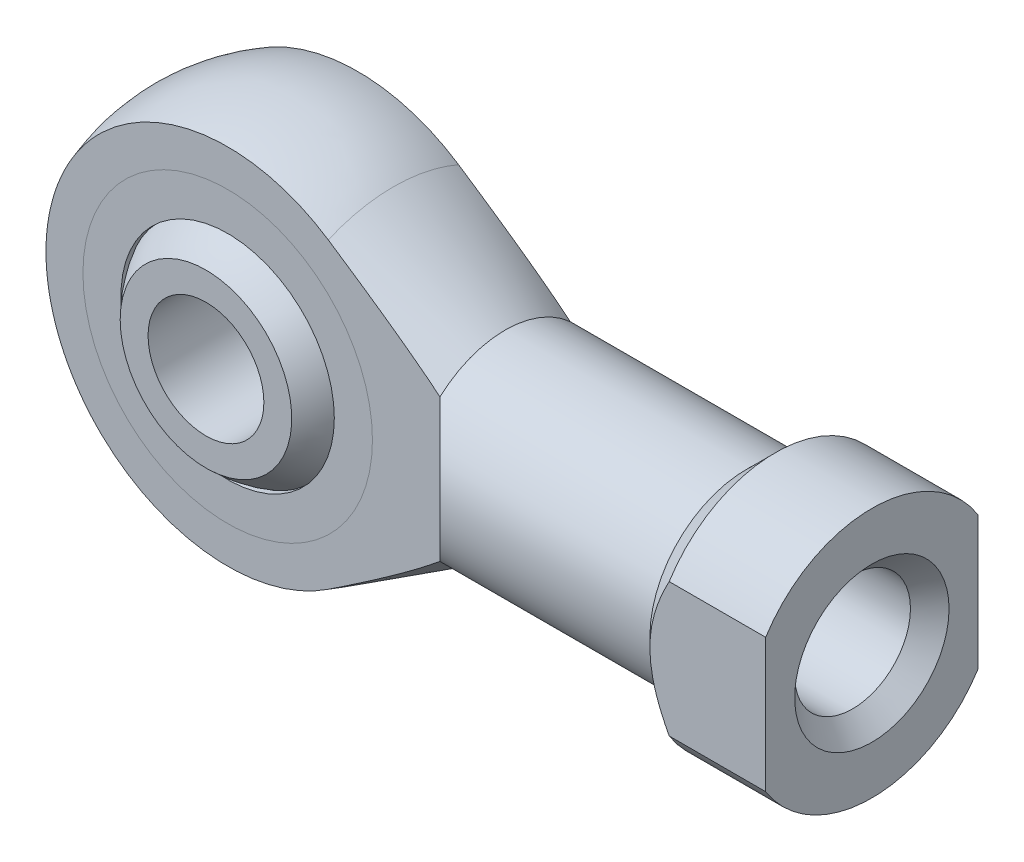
ISO-10303-21;
HEADER;
FILE_DESCRIPTION(('STEP AP214'),'2;1');
FILE_NAME('part.step','',(''),(''),'','','');
FILE_SCHEMA(('AUTOMOTIVE_DESIGN { 1 0 10303 214 1 1 1 1 }'));
ENDSEC;
DATA;
#1=APPLICATION_CONTEXT('core data for automotive mechanical design processes');
#2=APPLICATION_PROTOCOL_DEFINITION('international standard','automotive_design',2000,#1);
#3=PRODUCT_CONTEXT('',#1,'mechanical');
#4=PRODUCT('Part','Part','',(#3));
#5=PRODUCT_RELATED_PRODUCT_CATEGORY('part','',(#4));
#6=PRODUCT_DEFINITION_FORMATION('','',#4);
#7=PRODUCT_DEFINITION_CONTEXT('part definition',#1,'design');
#8=PRODUCT_DEFINITION('design','',#6,#7);
#9=PRODUCT_DEFINITION_SHAPE('','',#8);
#10=(LENGTH_UNIT() NAMED_UNIT(*) SI_UNIT(.MILLI.,.METRE.));
#11=(NAMED_UNIT(*) PLANE_ANGLE_UNIT() SI_UNIT($,.RADIAN.));
#12=(NAMED_UNIT(*) SI_UNIT($,.STERADIAN.) SOLID_ANGLE_UNIT());
#13=UNCERTAINTY_MEASURE_WITH_UNIT(LENGTH_MEASURE(1.E-05),#10,'distance_accuracy_value','');
#14=(GEOMETRIC_REPRESENTATION_CONTEXT(3) GLOBAL_UNCERTAINTY_ASSIGNED_CONTEXT((#13)) GLOBAL_UNIT_ASSIGNED_CONTEXT((#10,
#11,#12)) REPRESENTATION_CONTEXT('',''));
#15=CARTESIAN_POINT('',(0.,0.,0.));
#16=DIRECTION('',(0.,0.,1.));
#17=DIRECTION('',(1.,0.,0.));
#18=AXIS2_PLACEMENT_3D('',#15,#16,#17);
#19=CARTESIAN_POINT('',(0.,0.,0.));
#20=DIRECTION('',(0.,1.,0.));
#21=DIRECTION('',(1.,0.,0.));
#22=AXIS2_PLACEMENT_3D('',#19,#20,#21);
#23=SPHERICAL_SURFACE('',#22,6.325);
#24=CARTESIAN_POINT('',(0.,0.,0.));
#25=DIRECTION('',(0.,0.,-1.));
#26=DIRECTION('',(-1.,0.,0.));
#27=AXIS2_PLACEMENT_3D('',#24,#25,#26);
#28=SPHERICAL_SURFACE('',#27,6.325);
#29=CARTESIAN_POINT('',(0.,0.,4.5));
#30=DIRECTION('',(0.,0.,-1.));
#31=DIRECTION('',(-1.,0.,0.));
#32=AXIS2_PLACEMENT_3D('',#29,#30,#31);
#33=CIRCLE('',#32,4.44473002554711);
#34=CARTESIAN_POINT('',(-4.44473002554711,0.,4.5));
#35=VERTEX_POINT('',#34);
#36=EDGE_CURVE('P0_E26',#35,#35,#33,.F.);
#37=ORIENTED_EDGE('',*,*,#36,.F.);
#38=EDGE_LOOP('',(#37));
#39=FACE_BOUND('',#38,.T.);
#40=CARTESIAN_POINT('',(0.,0.,-4.5));
#41=DIRECTION('',(0.,0.,1.));
#42=DIRECTION('',(1.,0.,0.));
#43=AXIS2_PLACEMENT_3D('',#40,#41,#42);
#44=CIRCLE('',#43,4.44473002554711);
#45=CARTESIAN_POINT('',(4.44473002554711,0.,-4.5));
#46=VERTEX_POINT('',#45);
#47=EDGE_CURVE('P0_E10',#46,#46,#44,.F.);
#48=ORIENTED_EDGE('',*,*,#47,.F.);
#49=EDGE_LOOP('',(#48));
#50=FACE_BOUND('',#49,.T.);
#51=ADVANCED_FACE('P0_F14',(#39,#50),#28,.T.);
#52=CARTESIAN_POINT('',(0.,0.,-6.325));
#53=DIRECTION('',(0.,0.,1.));
#54=DIRECTION('',(1.,0.,0.));
#55=AXIS2_PLACEMENT_3D('',#52,#53,#54);
#56=CYLINDRICAL_SURFACE('',#55,3.);
#57=CARTESIAN_POINT('',(0.,0.,4.5));
#58=DIRECTION('',(0.,0.,-1.));
#59=DIRECTION('',(-1.,0.,0.));
#60=AXIS2_PLACEMENT_3D('',#57,#58,#59);
#61=CIRCLE('',#60,3.);
#62=CARTESIAN_POINT('',(-3.,0.,4.5));
#63=VERTEX_POINT('',#62);
#64=EDGE_CURVE('P0_E17',#63,#63,#61,.F.);
#65=ORIENTED_EDGE('',*,*,#64,.T.);
#66=EDGE_LOOP('',(#65));
#67=FACE_BOUND('',#66,.T.);
#68=CARTESIAN_POINT('',(0.,0.,-4.5));
#69=DIRECTION('',(0.,0.,1.));
#70=DIRECTION('',(1.,0.,0.));
#71=AXIS2_PLACEMENT_3D('',#68,#69,#70);
#72=CIRCLE('',#71,3.);
#73=CARTESIAN_POINT('',(3.,0.,-4.5));
#74=VERTEX_POINT('',#73);
#75=EDGE_CURVE('P0_E21',#74,#74,#72,.F.);
#76=ORIENTED_EDGE('',*,*,#75,.T.);
#77=EDGE_LOOP('',(#76));
#78=FACE_BOUND('',#77,.T.);
#79=ADVANCED_FACE('P0_F34',(#67,#78),#56,.F.);
#80=CARTESIAN_POINT('',(-6.325,-6.325,-4.5));
#81=DIRECTION('',(0.,0.,1.));
#82=DIRECTION('',(1.,0.,0.));
#83=AXIS2_PLACEMENT_3D('',#80,#81,#82);
#84=PLANE('',#83);
#85=ORIENTED_EDGE('',*,*,#47,.T.);
#86=EDGE_LOOP('',(#85));
#87=FACE_BOUND('',#86,.T.);
#88=ORIENTED_EDGE('',*,*,#75,.F.);
#89=EDGE_LOOP('',(#88));
#90=FACE_BOUND('',#89,.T.);
#91=ADVANCED_FACE('P0_F39',(#87,#90),#84,.F.);
#92=CARTESIAN_POINT('',(-6.325,-6.325,4.5));
#93=DIRECTION('',(0.,0.,-1.));
#94=DIRECTION('',(-1.,0.,0.));
#95=AXIS2_PLACEMENT_3D('',#92,#93,#94);
#96=PLANE('',#95);
#97=ORIENTED_EDGE('',*,*,#36,.T.);
#98=EDGE_LOOP('',(#97));
#99=FACE_BOUND('',#98,.T.);
#100=ORIENTED_EDGE('',*,*,#64,.F.);
#101=EDGE_LOOP('',(#100));
#102=FACE_BOUND('',#101,.T.);
#103=ADVANCED_FACE('P0_F37',(#99,#102),#96,.F.);
#104=CLOSED_SHELL('',(#51,#79,#91,#103));
#105=MANIFOLD_SOLID_BREP('P0_B1',#104);
#106=CARTESIAN_POINT('',(0.,0.,3.375));
#107=DIRECTION('',(0.,0.,1.));
#108=DIRECTION('',(1.,0.,0.));
#109=AXIS2_PLACEMENT_3D('',#106,#107,#108);
#110=PLANE('',#109);
#111=CARTESIAN_POINT('',(0.,0.,3.375));
#112=DIRECTION('',(0.,0.,1.));
#113=DIRECTION('',(1.,0.,0.));
#114=AXIS2_PLACEMENT_3D('',#111,#112,#113);
#115=CIRCLE('',#114,7.5);
#116=CARTESIAN_POINT('',(7.5,0.,3.375));
#117=VERTEX_POINT('',#116);
#118=EDGE_CURVE('P1_E10',#117,#117,#115,.T.);
#119=ORIENTED_EDGE('',*,*,#118,.T.);
#120=EDGE_LOOP('',(#119));
#121=FACE_BOUND('',#120,.T.);
#122=CARTESIAN_POINT('',(0.,0.,3.375));
#123=DIRECTION('',(0.,0.,1.));
#124=DIRECTION('',(1.,0.,0.));
#125=AXIS2_PLACEMENT_3D('',#122,#123,#124);
#126=CIRCLE('',#125,5.525);
#127=CARTESIAN_POINT('',(5.525,0.,3.375));
#128=VERTEX_POINT('',#127);
#129=EDGE_CURVE('P1_E25',#128,#128,#126,.T.);
#130=ORIENTED_EDGE('',*,*,#129,.F.);
#131=EDGE_LOOP('',(#130));
#132=FACE_BOUND('',#131,.T.);
#133=ADVANCED_FACE('P1_F14',(#121,#132),#110,.T.);
#134=CARTESIAN_POINT('',(0.,0.,3.075));
#135=DIRECTION('',(0.,0.,1.));
#136=DIRECTION('',(1.,0.,0.));
#137=AXIS2_PLACEMENT_3D('',#134,#135,#136);
#138=PLANE('',#137);
#139=CARTESIAN_POINT('',(0.,0.,3.075));
#140=DIRECTION('',(0.,0.,1.));
#141=DIRECTION('',(1.,0.,0.));
#142=AXIS2_PLACEMENT_3D('',#139,#140,#141);
#143=CIRCLE('',#142,7.5);
#144=CARTESIAN_POINT('',(7.5,0.,3.075));
#145=VERTEX_POINT('',#144);
#146=EDGE_CURVE('P1_E18',#145,#145,#143,.T.);
#147=ORIENTED_EDGE('',*,*,#146,.F.);
#148=EDGE_LOOP('',(#147));
#149=FACE_BOUND('',#148,.T.);
#150=CARTESIAN_POINT('',(0.,0.,3.075));
#151=DIRECTION('',(0.,0.,1.));
#152=DIRECTION('',(1.,0.,0.));
#153=AXIS2_PLACEMENT_3D('',#150,#151,#152);
#154=CIRCLE('',#153,5.525);
#155=CARTESIAN_POINT('',(5.525,0.,3.075));
#156=VERTEX_POINT('',#155);
#157=EDGE_CURVE('P1_E27',#156,#156,#154,.T.);
#158=ORIENTED_EDGE('',*,*,#157,.T.);
#159=EDGE_LOOP('',(#158));
#160=FACE_BOUND('',#159,.T.);
#161=ADVANCED_FACE('P1_F37',(#149,#160),#138,.F.);
#162=CARTESIAN_POINT('',(0.,0.,3.375));
#163=DIRECTION('',(0.,0.,-1.));
#164=DIRECTION('',(-1.,0.,0.));
#165=AXIS2_PLACEMENT_3D('',#162,#163,#164);
#166=CYLINDRICAL_SURFACE('',#165,7.5);
#167=ORIENTED_EDGE('',*,*,#118,.F.);
#168=EDGE_LOOP('',(#167));
#169=FACE_BOUND('',#168,.T.);
#170=ORIENTED_EDGE('',*,*,#146,.T.);
#171=EDGE_LOOP('',(#170));
#172=FACE_BOUND('',#171,.T.);
#173=ADVANCED_FACE('P1_F16',(#169,#172),#166,.T.);
#174=CARTESIAN_POINT('',(0.,0.,3.375));
#175=DIRECTION('',(0.,0.,-1.));
#176=DIRECTION('',(-1.,0.,0.));
#177=AXIS2_PLACEMENT_3D('',#174,#175,#176);
#178=CYLINDRICAL_SURFACE('',#177,5.525);
#179=ORIENTED_EDGE('',*,*,#129,.T.);
#180=EDGE_LOOP('',(#179));
#181=FACE_BOUND('',#180,.T.);
#182=ORIENTED_EDGE('',*,*,#157,.F.);
#183=EDGE_LOOP('',(#182));
#184=FACE_BOUND('',#183,.T.);
#185=ADVANCED_FACE('P1_F33',(#181,#184),#178,.F.);
#186=CLOSED_SHELL('',(#133,#161,#173,#185));
#187=MANIFOLD_SOLID_BREP('P1_B1',#186);
#188=CARTESIAN_POINT('',(0.,0.,-3.075));
#189=DIRECTION('',(0.,0.,1.));
#190=DIRECTION('',(1.,0.,0.));
#191=AXIS2_PLACEMENT_3D('',#188,#189,#190);
#192=PLANE('',#191);
#193=CARTESIAN_POINT('',(0.,0.,-3.075));
#194=DIRECTION('',(0.,0.,1.));
#195=DIRECTION('',(1.,0.,0.));
#196=AXIS2_PLACEMENT_3D('',#193,#194,#195);
#197=CIRCLE('',#196,7.5);
#198=CARTESIAN_POINT('',(7.5,0.,-3.075));
#199=VERTEX_POINT('',#198);
#200=EDGE_CURVE('P2_E10',#199,#199,#197,.T.);
#201=ORIENTED_EDGE('',*,*,#200,.T.);
#202=EDGE_LOOP('',(#201));
#203=FACE_BOUND('',#202,.T.);
#204=CARTESIAN_POINT('',(0.,0.,-3.075));
#205=DIRECTION('',(0.,0.,1.));
#206=DIRECTION('',(1.,0.,0.));
#207=AXIS2_PLACEMENT_3D('',#204,#205,#206);
#208=CIRCLE('',#207,5.525);
#209=CARTESIAN_POINT('',(5.525,0.,-3.075));
#210=VERTEX_POINT('',#209);
#211=EDGE_CURVE('P2_E25',#210,#210,#208,.T.);
#212=ORIENTED_EDGE('',*,*,#211,.F.);
#213=EDGE_LOOP('',(#212));
#214=FACE_BOUND('',#213,.T.);
#215=ADVANCED_FACE('P2_F14',(#203,#214),#192,.T.);
#216=CARTESIAN_POINT('',(0.,0.,-3.375));
#217=DIRECTION('',(0.,0.,1.));
#218=DIRECTION('',(1.,0.,0.));
#219=AXIS2_PLACEMENT_3D('',#216,#217,#218);
#220=PLANE('',#219);
#221=CARTESIAN_POINT('',(0.,0.,-3.375));
#222=DIRECTION('',(0.,0.,1.));
#223=DIRECTION('',(1.,0.,0.));
#224=AXIS2_PLACEMENT_3D('',#221,#222,#223);
#225=CIRCLE('',#224,7.5);
#226=CARTESIAN_POINT('',(7.5,0.,-3.375));
#227=VERTEX_POINT('',#226);
#228=EDGE_CURVE('P2_E18',#227,#227,#225,.T.);
#229=ORIENTED_EDGE('',*,*,#228,.F.);
#230=EDGE_LOOP('',(#229));
#231=FACE_BOUND('',#230,.T.);
#232=CARTESIAN_POINT('',(0.,0.,-3.375));
#233=DIRECTION('',(0.,0.,1.));
#234=DIRECTION('',(1.,0.,0.));
#235=AXIS2_PLACEMENT_3D('',#232,#233,#234);
#236=CIRCLE('',#235,5.525);
#237=CARTESIAN_POINT('',(5.525,0.,-3.375));
#238=VERTEX_POINT('',#237);
#239=EDGE_CURVE('P2_E27',#238,#238,#236,.T.);
#240=ORIENTED_EDGE('',*,*,#239,.T.);
#241=EDGE_LOOP('',(#240));
#242=FACE_BOUND('',#241,.T.);
#243=ADVANCED_FACE('P2_F37',(#231,#242),#220,.F.);
#244=CARTESIAN_POINT('',(0.,0.,-3.075));
#245=DIRECTION('',(0.,0.,-1.));
#246=DIRECTION('',(-1.,0.,0.));
#247=AXIS2_PLACEMENT_3D('',#244,#245,#246);
#248=CYLINDRICAL_SURFACE('',#247,7.5);
#249=ORIENTED_EDGE('',*,*,#200,.F.);
#250=EDGE_LOOP('',(#249));
#251=FACE_BOUND('',#250,.T.);
#252=ORIENTED_EDGE('',*,*,#228,.T.);
#253=EDGE_LOOP('',(#252));
#254=FACE_BOUND('',#253,.T.);
#255=ADVANCED_FACE('P2_F16',(#251,#254),#248,.T.);
#256=CARTESIAN_POINT('',(0.,0.,-3.075));
#257=DIRECTION('',(0.,0.,-1.));
#258=DIRECTION('',(-1.,0.,0.));
#259=AXIS2_PLACEMENT_3D('',#256,#257,#258);
#260=CYLINDRICAL_SURFACE('',#259,5.525);
#261=ORIENTED_EDGE('',*,*,#211,.T.);
#262=EDGE_LOOP('',(#261));
#263=FACE_BOUND('',#262,.T.);
#264=ORIENTED_EDGE('',*,*,#239,.F.);
#265=EDGE_LOOP('',(#264));
#266=FACE_BOUND('',#265,.T.);
#267=ADVANCED_FACE('P2_F33',(#263,#266),#260,.F.);
#268=CLOSED_SHELL('',(#215,#243,#255,#267));
#269=MANIFOLD_SOLID_BREP('P2_B1',#268);
#270=CARTESIAN_POINT('',(0.,0.,0.));
#271=DIRECTION('',(0.,1.,0.));
#272=DIRECTION('',(1.,0.,0.));
#273=AXIS2_PLACEMENT_3D('',#270,#271,#272);
#274=SPHERICAL_SURFACE('',#273,6.325);
#275=CARTESIAN_POINT('',(0.,0.,0.));
#276=DIRECTION('',(0.,0.,1.));
#277=DIRECTION('',(1.,0.,0.));
#278=AXIS2_PLACEMENT_3D('',#275,#276,#277);
#279=SPHERICAL_SURFACE('',#278,6.325);
#280=CARTESIAN_POINT('',(0.,0.,3.075));
#281=DIRECTION('',(0.,0.,1.));
#282=DIRECTION('',(1.,0.,0.));
#283=AXIS2_PLACEMENT_3D('',#280,#281,#282);
#284=CIRCLE('',#283,5.52720544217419);
#285=CARTESIAN_POINT('',(5.52720544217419,0.,3.075));
#286=VERTEX_POINT('',#285);
#287=EDGE_CURVE('P3_E73',#286,#286,#284,.F.);
#288=ORIENTED_EDGE('',*,*,#287,.F.);
#289=EDGE_LOOP('',(#288));
#290=FACE_BOUND('',#289,.T.);
#291=CARTESIAN_POINT('',(0.,0.,-3.075));
#292=DIRECTION('',(0.,0.,-1.));
#293=DIRECTION('',(-1.,0.,0.));
#294=AXIS2_PLACEMENT_3D('',#291,#292,#293);
#295=CIRCLE('',#294,5.52720544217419);
#296=CARTESIAN_POINT('',(-5.52720544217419,0.,-3.075));
#297=VERTEX_POINT('',#296);
#298=EDGE_CURVE('P3_E20',#297,#297,#295,.F.);
#299=ORIENTED_EDGE('',*,*,#298,.F.);
#300=EDGE_LOOP('',(#299));
#301=FACE_BOUND('',#300,.T.);
#302=ADVANCED_FACE('P3_F16',(#290,#301),#279,.F.);
#303=CARTESIAN_POINT('',(-11.,-10.,-3.375));
#304=DIRECTION('',(0.,0.,1.));
#305=DIRECTION('',(1.,0.,0.));
#306=AXIS2_PLACEMENT_3D('',#303,#304,#305);
#307=PLANE('',#306);
#308=CARTESIAN_POINT('',(0.,0.,-3.375));
#309=DIRECTION('',(0.,0.,1.));
#310=DIRECTION('',(1.,0.,0.));
#311=AXIS2_PLACEMENT_3D('',#308,#309,#310);
#312=CIRCLE('',#311,9.41325528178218);
#313=CARTESIAN_POINT('',(5.21153082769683,7.83896175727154,-3.375));
#314=VERTEX_POINT('',#313);
#315=CARTESIAN_POINT('',(5.21153082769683,-7.83896175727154,-3.375));
#316=VERTEX_POINT('',#315);
#317=EDGE_CURVE('P3_E11',#314,#316,#312,.T.);
#318=ORIENTED_EDGE('',*,*,#317,.F.);
#319=CARTESIAN_POINT('',(-48.1059219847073,-40.9532122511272,-3.375));
#320=CARTESIAN_POINT('',(-46.1856765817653,-39.7766542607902,-3.375));
#321=CARTESIAN_POINT('',(-44.2655690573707,-38.5998710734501,-3.375));
#322=CARTESIAN_POINT('',(-40.4257541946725,-36.2456458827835,-3.375));
#323=CARTESIAN_POINT('',(-38.506046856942,-35.0682038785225,-3.375));
#324=CARTESIAN_POINT('',(-34.6670621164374,-32.7123945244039,-3.375));
#325=CARTESIAN_POINT('',(-32.7477847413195,-31.5340271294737,-3.375));
#326=CARTESIAN_POINT('',(-28.9099703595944,-29.1760922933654,-3.375));
#327=CARTESIAN_POINT('',(-26.9914333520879,-27.9965248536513,-3.375));
#328=CARTESIAN_POINT('',(-23.157016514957,-25.6366312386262,-3.375));
#329=CARTESIAN_POINT('',(-21.2411358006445,-24.456306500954,-3.375));
#330=CARTESIAN_POINT('',(-17.4109775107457,-22.093041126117,-3.375));
#331=CARTESIAN_POINT('',(-15.4966999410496,-20.9101004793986,-3.375));
#332=CARTESIAN_POINT('',(-12.6273077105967,-19.132476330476,-3.375));
#333=CARTESIAN_POINT('',(-11.6711931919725,-18.5394070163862,-3.375));
#334=CARTESIAN_POINT('',(-9.75986009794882,-17.3518267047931,-3.375));
#335=CARTESIAN_POINT('',(-8.80464152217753,-16.7573157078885,-3.375));
#336=CARTESIAN_POINT('',(-6.8954308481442,-15.5663396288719,-3.375));
#337=CARTESIAN_POINT('',(-5.94143874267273,-14.9698745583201,-3.375));
#338=CARTESIAN_POINT('',(-4.03517978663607,-13.774194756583,-3.375));
#339=CARTESIAN_POINT('',(-3.08291293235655,-13.1749800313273,-3.375));
#340=CARTESIAN_POINT('',(-1.85519611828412,-12.3987515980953,-3.375));
#341=CARTESIAN_POINT('',(-1.57856387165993,-12.2236076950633,-3.375));
#342=CARTESIAN_POINT('',(-1.02555178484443,-11.8729216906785,-3.375));
#343=CARTESIAN_POINT('',(-0.749171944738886,-11.6973795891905,-3.375));
#344=CARTESIAN_POINT('',(0.0795412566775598,-11.1700779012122,-3.375));
#345=CARTESIAN_POINT('',(0.631446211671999,-10.817644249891,-3.375));
#346=CARTESIAN_POINT('',(1.73392646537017,-10.1102832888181,-3.375));
#347=CARTESIAN_POINT('',(2.28450123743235,-9.7553551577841,-3.375));
#348=CARTESIAN_POINT('',(3.38356276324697,-9.04228336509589,-3.375));
#349=CARTESIAN_POINT('',(3.93204953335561,-8.68413972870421,-3.375));
#350=CARTESIAN_POINT('',(4.81702471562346,-8.10100410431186,-3.375));
#351=CARTESIAN_POINT('',(5.15444159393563,-7.87742182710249,-3.375));
#352=CARTESIAN_POINT('',(5.82780197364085,-7.42803805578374,-3.375));
#353=CARTESIAN_POINT('',(6.1637454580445,-7.2022365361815,-3.375));
#354=CARTESIAN_POINT('',(6.83346720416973,-6.74792359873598,-3.375));
#355=CARTESIAN_POINT('',(7.1672467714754,-6.51941410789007,-3.375));
#356=CARTESIAN_POINT('',(7.83218261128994,-6.05861805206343,-3.375));
#357=CARTESIAN_POINT('',(8.16333896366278,-5.82633160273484,-3.375));
#358=CARTESIAN_POINT('',(8.698194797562,-5.44483852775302,-3.375));
#359=CARTESIAN_POINT('',(8.90302338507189,-5.29721637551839,-3.375));
#360=CARTESIAN_POINT('',(9.31084090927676,-4.99945212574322,-3.375));
#361=CARTESIAN_POINT('',(9.51382986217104,-4.84931005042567,-3.375));
#362=CARTESIAN_POINT('',(9.91782975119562,-4.54554994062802,-3.375));
#363=CARTESIAN_POINT('',(10.1188359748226,-4.39192561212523,-3.375));
#364=CARTESIAN_POINT('',(10.4179188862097,-4.15841694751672,-3.375));
#365=CARTESIAN_POINT('',(10.5172003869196,-4.08007553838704,-3.375));
#366=CARTESIAN_POINT('',(10.7148269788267,-3.92219960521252,-3.375));
#367=CARTESIAN_POINT('',(10.8131719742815,-3.84266496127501,-3.375));
#368=CARTESIAN_POINT('',(11.0881200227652,-3.61713003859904,-3.375));
#369=CARTESIAN_POINT('',(11.2634558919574,-3.46957691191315,-3.375));
#370=CARTESIAN_POINT('',(11.609041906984,-3.16863262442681,-3.375));
#371=CARTESIAN_POINT('',(11.7792930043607,-3.01524256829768,-3.375));
#372=CARTESIAN_POINT('',(12.0288957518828,-2.77936770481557,-3.375));
#373=CARTESIAN_POINT('',(12.1110573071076,-2.69985785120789,-3.375));
#374=CARTESIAN_POINT('',(12.2730574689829,-2.53851145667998,-3.375));
#375=CARTESIAN_POINT('',(12.3528963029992,-2.45667514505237,-3.375));
#376=CARTESIAN_POINT('',(12.5095984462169,-2.29033253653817,-3.375));
#377=CARTESIAN_POINT('',(12.5864644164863,-2.2058287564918,-3.375));
#378=CARTESIAN_POINT('',(12.7364796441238,-2.033598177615,-3.375));
#379=CARTESIAN_POINT('',(12.8096298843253,-1.94587224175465,-3.375));
#380=CARTESIAN_POINT('',(12.9343491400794,-1.78783716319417,-3.375));
#381=CARTESIAN_POINT('',(12.9869253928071,-1.71832538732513,-3.375));
#382=CARTESIAN_POINT('',(13.0886122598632,-1.57678340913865,-3.375));
#383=CARTESIAN_POINT('',(13.1377224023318,-1.50475286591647,-3.375));
#384=CARTESIAN_POINT('',(13.2315932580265,-1.35793720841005,-3.375));
#385=CARTESIAN_POINT('',(13.2763564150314,-1.28315367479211,-3.375));
#386=CARTESIAN_POINT('',(13.3604617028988,-1.13063755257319,-3.375));
#387=CARTESIAN_POINT('',(13.3998056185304,-1.05290594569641,-3.375));
#388=CARTESIAN_POINT('',(13.4907970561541,-0.852390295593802,-3.375));
#389=CARTESIAN_POINT('',(13.5379905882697,-0.727465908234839,-3.375));
#390=CARTESIAN_POINT('',(13.5929090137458,-0.535780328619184,-3.375));
#391=CARTESIAN_POINT('',(13.608560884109,-0.47124569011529,-3.375));
#392=CARTESIAN_POINT('',(13.6340291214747,-0.341047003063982,-3.375));
#393=CARTESIAN_POINT('',(13.6438495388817,-0.275383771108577,-3.375));
#394=CARTESIAN_POINT('',(13.6540702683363,-0.174635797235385,-3.375));
#395=CARTESIAN_POINT('',(13.6567291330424,-0.139767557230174,-3.375));
#396=CARTESIAN_POINT('',(13.6602806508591,-0.0699350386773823,-3.375));
#397=CARTESIAN_POINT('',(13.6611729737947,-0.0349707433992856,-3.375));
#398=CARTESIAN_POINT('',(13.6611685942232,0.06869217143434,-3.375));
#399=CARTESIAN_POINT('',(13.6577170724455,0.13740922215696,-3.375));
#400=CARTESIAN_POINT('',(13.6440941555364,0.274187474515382,-3.375));
#401=CARTESIAN_POINT('',(13.6339179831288,0.342248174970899,-3.375));
#402=CARTESIAN_POINT('',(13.5938970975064,0.544892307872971,-3.375));
#403=CARTESIAN_POINT('',(13.5545627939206,0.677669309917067,-3.375));
#404=CARTESIAN_POINT('',(13.4701629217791,0.899541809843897,-3.375));
#405=CARTESIAN_POINT('',(13.4297301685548,0.990519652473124,-3.375));
#406=CARTESIAN_POINT('',(13.3408927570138,1.16856176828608,-3.375));
#407=CARTESIAN_POINT('',(13.2924826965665,1.25562333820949,-3.375));
#408=CARTESIAN_POINT('',(13.1893446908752,1.42621461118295,-3.375));
#409=CARTESIAN_POINT('',(13.1345985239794,1.50973313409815,-3.375));
#410=CARTESIAN_POINT('',(13.020308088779,1.67334896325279,-3.375));
#411=CARTESIAN_POINT('',(12.960765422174,1.75344739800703,-3.375));
#412=CARTESIAN_POINT('',(12.7938249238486,1.96714692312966,-3.375));
#413=CARTESIAN_POINT('',(12.6827601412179,2.09787452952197,-3.375));
#414=CARTESIAN_POINT('',(12.4531204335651,2.35260584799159,-3.375));
#415=CARTESIAN_POINT('',(12.3345400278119,2.47660452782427,-3.375));
#416=CARTESIAN_POINT('',(12.0918314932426,2.71957112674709,-3.375));
#417=CARTESIAN_POINT('',(11.9676915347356,2.83852715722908,-3.375));
#418=CARTESIAN_POINT('',(11.7155273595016,3.07225473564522,-3.375));
#419=CARTESIAN_POINT('',(11.5875026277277,3.18702572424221,-3.375));
#420=CARTESIAN_POINT('',(11.3277646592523,3.41388384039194,-3.375));
#421=CARTESIAN_POINT('',(11.196034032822,3.52595098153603,-3.375));
#422=CARTESIAN_POINT('',(10.9302815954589,3.74734254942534,-3.375));
#423=CARTESIAN_POINT('',(10.7962596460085,3.85666680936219,-3.375));
#424=CARTESIAN_POINT('',(10.5266218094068,4.07289064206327,-3.375));
#425=CARTESIAN_POINT('',(10.3910087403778,4.17979373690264,-3.375));
#426=CARTESIAN_POINT('',(10.1183351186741,4.39172485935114,-3.375));
#427=CARTESIAN_POINT('',(9.98127461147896,4.49675294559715,-3.375));
#428=CARTESIAN_POINT('',(9.57248270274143,4.80634338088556,-3.375));
#429=CARTESIAN_POINT('',(9.29904935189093,5.00865798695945,-3.375));
#430=CARTESIAN_POINT('',(8.74897501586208,5.40888651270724,-3.375));
#431=CARTESIAN_POINT('',(8.47233385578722,5.60680019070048,-3.375));
#432=CARTESIAN_POINT('',(7.91665464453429,5.99932933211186,-3.375));
#433=CARTESIAN_POINT('',(7.63761619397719,6.19394422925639,-3.375));
#434=CARTESIAN_POINT('',(7.07775946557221,6.58059986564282,-3.375));
#435=CARTESIAN_POINT('',(6.79694116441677,6.77264057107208,-3.375));
#436=CARTESIAN_POINT('',(6.23362499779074,7.1548903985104,-3.375));
#437=CARTESIAN_POINT('',(5.95112566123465,7.34509735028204,-3.375));
#438=CARTESIAN_POINT('',(5.38502750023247,7.7238689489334,-3.375));
#439=CARTESIAN_POINT('',(5.10142867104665,7.91243358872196,-3.375));
#440=CARTESIAN_POINT('',(4.24937357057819,8.47609256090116,-3.375));
#441=CARTESIAN_POINT('',(3.67959836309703,8.84919266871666,-3.375));
#442=CARTESIAN_POINT('',(2.54111874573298,9.58948153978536,-3.375));
#443=CARTESIAN_POINT('',(1.97242866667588,9.9566923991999,-3.375));
#444=CARTESIAN_POINT('',(0.833342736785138,10.6884889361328,-3.375));
#445=CARTESIAN_POINT('',(0.26294684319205,11.0530745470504,-3.375));
#446=CARTESIAN_POINT('',(-0.878800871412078,11.7800882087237,-3.375));
#447=CARTESIAN_POINT('',(-1.45015204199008,12.1425172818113,-3.375));
#448=CARTESIAN_POINT('',(-2.59380604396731,12.8658593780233,-3.375));
#449=CARTESIAN_POINT('',(-3.16610886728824,13.2267724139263,-3.375));
#450=CARTESIAN_POINT('',(-4.65329557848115,14.1625002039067,-3.375));
#451=CARTESIAN_POINT('',(-5.56875510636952,14.7363998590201,-3.375));
#452=CARTESIAN_POINT('',(-7.40099566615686,15.8820864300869,-3.375));
#453=CARTESIAN_POINT('',(-8.31777669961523,16.4538733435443,-3.375));
#454=CARTESIAN_POINT('',(-10.1523096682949,17.5958999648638,-3.375));
#455=CARTESIAN_POINT('',(-11.0700616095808,18.1661396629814,-3.375));
#456=CARTESIAN_POINT('',(-12.9062926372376,19.3054472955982,-3.375));
#457=CARTESIAN_POINT('',(-13.8247717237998,19.8745152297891,-3.375));
#458=CARTESIAN_POINT('',(-16.5814831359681,21.5806516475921,-3.375));
#459=CARTESIAN_POINT('',(-18.4205464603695,22.7163772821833,-3.375));
#460=CARTESIAN_POINT('',(-22.100053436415,24.9855767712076,-3.375));
#461=CARTESIAN_POINT('',(-23.9404970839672,26.11905063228,-3.375));
#462=CARTESIAN_POINT('',(-27.6407403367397,28.395803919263,-3.375));
#463=CARTESIAN_POINT('',(-29.5005493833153,29.5390679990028,-3.375));
#464=CARTESIAN_POINT('',(-33.2208416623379,31.8245026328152,-3.375));
#465=CARTESIAN_POINT('',(-35.0813248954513,32.966673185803,-3.375));
#466=CARTESIAN_POINT('',(-38.8022857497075,35.2499135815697,-3.375));
#467=CARTESIAN_POINT('',(-40.6627632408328,36.3909836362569,-3.375));
#468=CARTESIAN_POINT('',(-44.3840909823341,38.6725109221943,-3.375));
#469=CARTESIAN_POINT('',(-46.2449412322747,39.8129681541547,-3.375));
#470=CARTESIAN_POINT('',(-48.1059219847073,40.9532122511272,-3.375));
#471=B_SPLINE_CURVE_WITH_KNOTS('',3,(#319,#320,#321,#322,#323,#324,#325,#326,#327,#328,#329,
#330,#331,#332,#333,#334,#335,#336,#337,#338,#339,#340,#341,#342,#343,#344,#345,#346,#347,#348,
#349,#350,#351,#352,#353,#354,#355,#356,#357,#358,#359,#360,#361,#362,#363,#364,#365,#366,#367,
#368,#369,#370,#371,#372,#373,#374,#375,#376,#377,#378,#379,#380,#381,#382,#383,#384,#385,#386,
#387,#388,#389,#390,#391,#392,#393,#394,#395,#396,#397,#398,#399,#400,#401,#402,#403,#404,#405,
#406,#407,#408,#409,#410,#411,#412,#413,#414,#415,#416,#417,#418,#419,#420,#421,#422,#423,#424,
#425,#426,#427,#428,#429,#430,#431,#432,#433,#434,#435,#436,#437,#438,#439,#440,#441,#442,#443,
#444,#445,#446,#447,#448,#449,#450,#451,#452,#453,#454,#455,#456,#457,#458,#459,#460,#461,#462,
#463,#464,#465,#466,#467,#468,#469,#470),.UNSPECIFIED.,.F.,.F.,(4,2,2,2,2,2,2,2,2,2,2,2,2,2,2,2,
2,2,2,2,2,2,2,2,2,2,2,2,2,2,2,2,2,2,2,2,2,2,2,2,2,2,2,2,2,2,2,2,2,2,2,2,2,2,2,2,2,2,2,2,2,2,2,2,
2,2,2,2,2,2,2,2,2,2,2,4),(0.,6.75608478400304,13.5121791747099,20.268626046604,27.0250646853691,
33.7759072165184,40.526774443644,43.9021217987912,47.2774677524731,50.6527937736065,
54.0281125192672,55.0103581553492,55.9926041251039,57.9571034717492,59.9222831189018,
61.8874473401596,63.1017525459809,64.3160717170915,65.529573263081,66.7430377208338,
67.500468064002,68.2578917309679,69.0168151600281,69.3962118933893,69.7756470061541,
70.4630414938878,71.150306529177,71.4932731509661,71.8362060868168,72.1788245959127,
72.5213520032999,72.7827334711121,73.0441504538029,73.3054196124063,73.5666025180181,
73.9655276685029,74.1645308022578,74.3633955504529,74.4682644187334,74.5731528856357,
74.7791827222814,74.9853590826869,75.3985041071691,75.6968006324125,75.9952999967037,
76.2946801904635,76.5939608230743,77.1081041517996,77.6226268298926,78.1383018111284,
78.6540454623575,79.1728519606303,79.6916899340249,80.2097171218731,80.7277280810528,
81.748085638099,82.7684990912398,83.7890859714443,84.8096862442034,85.8313742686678,
86.8530667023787,88.8962332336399,90.92705477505,92.9579276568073,94.987745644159,
97.0175464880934,100.258967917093,103.500393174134,106.741838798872,109.98328527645,
116.467743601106,122.952182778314,129.501493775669,136.050811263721,142.598387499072,
149.14595612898),.UNSPECIFIED.);
#472=CARTESIAN_POINT('',(11.,3.68908864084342,-3.375));
#473=VERTEX_POINT('',#472);
#474=EDGE_CURVE('P3_E102',#473,#314,#471,.T.);
#475=ORIENTED_EDGE('',*,*,#474,.F.);
#476=DIRECTION('',(0.,1.,0.));
#477=VECTOR('',#476,1.);
#478=CARTESIAN_POINT('',(11.,-10.,-3.375));
#479=LINE('',#478,#477);
#480=CARTESIAN_POINT('',(11.,-3.68908864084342,-3.375));
#481=VERTEX_POINT('',#480);
#482=EDGE_CURVE('P3_E64',#481,#473,#479,.T.);
#483=ORIENTED_EDGE('',*,*,#482,.F.);
#484=EDGE_CURVE('P3_E33',#316,#481,#471,.T.);
#485=ORIENTED_EDGE('',*,*,#484,.F.);
#486=EDGE_LOOP('',(#318,#475,#483,#485));
#487=FACE_BOUND('',#486,.T.);
#488=CARTESIAN_POINT('',(0.,0.,-3.375));
#489=DIRECTION('',(0.,0.,1.));
#490=DIRECTION('',(1.,0.,0.));
#491=AXIS2_PLACEMENT_3D('',#488,#489,#490);
#492=CIRCLE('',#491,7.5);
#493=CARTESIAN_POINT('',(7.5,0.,-3.375));
#494=VERTEX_POINT('',#493);
#495=EDGE_CURVE('P3_E95',#494,#494,#492,.T.);
#496=ORIENTED_EDGE('',*,*,#495,.T.);
#497=EDGE_LOOP('',(#496));
#498=FACE_BOUND('',#497,.T.);
#499=ADVANCED_FACE('P3_F115',(#487,#498),#307,.F.);
#500=CARTESIAN_POINT('',(11.,0.,0.));
#501=DIRECTION('',(-1.,0.,0.));
#502=DIRECTION('',(0.,0.,1.));
#503=AXIS2_PLACEMENT_3D('',#500,#501,#502);
#504=CONICAL_SURFACE('',#503,5.,0.548201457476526);
#505=CARTESIAN_POINT('',(5.21153082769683,0.,0.));
#506=DIRECTION('',(-1.,0.,0.));
#507=DIRECTION('',(0.,0.,1.));
#508=AXIS2_PLACEMENT_3D('',#505,#506,#507);
#509=CIRCLE('',#508,8.53463217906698);
#510=CARTESIAN_POINT('',(5.21153082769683,-7.83896175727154,3.375));
#511=VERTEX_POINT('',#510);
#512=EDGE_CURVE('P3_E79',#316,#511,#509,.T.);
#513=ORIENTED_EDGE('',*,*,#512,.F.);
#514=ORIENTED_EDGE('',*,*,#484,.T.);
#515=CARTESIAN_POINT('',(11.,0.,0.));
#516=DIRECTION('',(-1.,0.,0.));
#517=DIRECTION('',(0.,0.,1.));
#518=AXIS2_PLACEMENT_3D('',#515,#516,#517);
#519=CIRCLE('',#518,5.);
#520=CARTESIAN_POINT('',(11.,-3.68908864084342,3.375));
#521=VERTEX_POINT('',#520);
#522=EDGE_CURVE('P3_E70',#481,#521,#519,.T.);
#523=ORIENTED_EDGE('',*,*,#522,.T.);
#524=CARTESIAN_POINT('',(-48.1059219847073,40.9532122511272,3.375));
#525=CARTESIAN_POINT('',(-46.1856765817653,39.7766542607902,3.375));
#526=CARTESIAN_POINT('',(-44.2655690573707,38.5998710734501,3.375));
#527=CARTESIAN_POINT('',(-40.4257541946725,36.2456458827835,3.375));
#528=CARTESIAN_POINT('',(-38.506046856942,35.0682038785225,3.375));
#529=CARTESIAN_POINT('',(-34.6670621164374,32.7123945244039,3.375));
#530=CARTESIAN_POINT('',(-32.7477847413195,31.5340271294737,3.375));
#531=CARTESIAN_POINT('',(-28.9099703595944,29.1760922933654,3.375));
#532=CARTESIAN_POINT('',(-26.9914333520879,27.9965248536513,3.375));
#533=CARTESIAN_POINT('',(-23.157016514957,25.6366312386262,3.375));
#534=CARTESIAN_POINT('',(-21.2411358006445,24.456306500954,3.375));
#535=CARTESIAN_POINT('',(-17.4109775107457,22.093041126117,3.375));
#536=CARTESIAN_POINT('',(-15.4966999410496,20.9101004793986,3.375));
#537=CARTESIAN_POINT('',(-12.6273077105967,19.132476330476,3.375));
#538=CARTESIAN_POINT('',(-11.6711931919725,18.5394070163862,3.375));
#539=CARTESIAN_POINT('',(-9.75986009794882,17.3518267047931,3.375));
#540=CARTESIAN_POINT('',(-8.80464152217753,16.7573157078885,3.375));
#541=CARTESIAN_POINT('',(-6.8954308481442,15.5663396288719,3.375));
#542=CARTESIAN_POINT('',(-5.94143874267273,14.9698745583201,3.375));
#543=CARTESIAN_POINT('',(-4.03517978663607,13.774194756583,3.375));
#544=CARTESIAN_POINT('',(-3.08291293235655,13.1749800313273,3.375));
#545=CARTESIAN_POINT('',(-1.85519611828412,12.3987515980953,3.375));
#546=CARTESIAN_POINT('',(-1.57856387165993,12.2236076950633,3.375));
#547=CARTESIAN_POINT('',(-1.02555178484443,11.8729216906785,3.375));
#548=CARTESIAN_POINT('',(-0.749171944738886,11.6973795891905,3.375));
#549=CARTESIAN_POINT('',(0.0795412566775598,11.1700779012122,3.375));
#550=CARTESIAN_POINT('',(0.631446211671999,10.817644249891,3.375));
#551=CARTESIAN_POINT('',(1.73392646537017,10.1102832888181,3.375));
#552=CARTESIAN_POINT('',(2.28450123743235,9.7553551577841,3.375));
#553=CARTESIAN_POINT('',(3.38356276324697,9.04228336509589,3.375));
#554=CARTESIAN_POINT('',(3.93204953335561,8.68413972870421,3.375));
#555=CARTESIAN_POINT('',(4.81702471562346,8.10100410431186,3.375));
#556=CARTESIAN_POINT('',(5.15444159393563,7.87742182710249,3.375));
#557=CARTESIAN_POINT('',(5.82780197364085,7.42803805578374,3.375));
#558=CARTESIAN_POINT('',(6.1637454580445,7.2022365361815,3.375));
#559=CARTESIAN_POINT('',(6.83346720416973,6.74792359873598,3.375));
#560=CARTESIAN_POINT('',(7.1672467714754,6.51941410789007,3.375));
#561=CARTESIAN_POINT('',(7.83218261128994,6.05861805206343,3.375));
#562=CARTESIAN_POINT('',(8.16333896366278,5.82633160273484,3.375));
#563=CARTESIAN_POINT('',(8.698194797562,5.44483852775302,3.375));
#564=CARTESIAN_POINT('',(8.90302338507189,5.29721637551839,3.375));
#565=CARTESIAN_POINT('',(9.31084090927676,4.99945212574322,3.375));
#566=CARTESIAN_POINT('',(9.51382986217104,4.84931005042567,3.375));
#567=CARTESIAN_POINT('',(9.91782975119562,4.54554994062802,3.375));
#568=CARTESIAN_POINT('',(10.1188359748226,4.39192561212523,3.375));
#569=CARTESIAN_POINT('',(10.4179188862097,4.15841694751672,3.375));
#570=CARTESIAN_POINT('',(10.5172003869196,4.08007553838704,3.375));
#571=CARTESIAN_POINT('',(10.7148269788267,3.92219960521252,3.375));
#572=CARTESIAN_POINT('',(10.8131719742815,3.84266496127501,3.375));
#573=CARTESIAN_POINT('',(11.0881200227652,3.61713003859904,3.375));
#574=CARTESIAN_POINT('',(11.2634558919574,3.46957691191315,3.375));
#575=CARTESIAN_POINT('',(11.609041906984,3.16863262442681,3.375));
#576=CARTESIAN_POINT('',(11.7792930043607,3.01524256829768,3.375));
#577=CARTESIAN_POINT('',(12.0288957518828,2.77936770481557,3.375));
#578=CARTESIAN_POINT('',(12.1110573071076,2.69985785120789,3.375));
#579=CARTESIAN_POINT('',(12.2730574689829,2.53851145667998,3.375));
#580=CARTESIAN_POINT('',(12.3528963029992,2.45667514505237,3.375));
#581=CARTESIAN_POINT('',(12.5095984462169,2.29033253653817,3.375));
#582=CARTESIAN_POINT('',(12.5864644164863,2.2058287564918,3.375));
#583=CARTESIAN_POINT('',(12.7364796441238,2.033598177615,3.375));
#584=CARTESIAN_POINT('',(12.8096298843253,1.94587224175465,3.375));
#585=CARTESIAN_POINT('',(12.9343491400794,1.78783716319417,3.375));
#586=CARTESIAN_POINT('',(12.9869253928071,1.71832538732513,3.375));
#587=CARTESIAN_POINT('',(13.0886122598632,1.57678340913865,3.375));
#588=CARTESIAN_POINT('',(13.1377224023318,1.50475286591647,3.375));
#589=CARTESIAN_POINT('',(13.2315932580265,1.35793720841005,3.375));
#590=CARTESIAN_POINT('',(13.2763564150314,1.28315367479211,3.375));
#591=CARTESIAN_POINT('',(13.3604617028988,1.13063755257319,3.375));
#592=CARTESIAN_POINT('',(13.3998056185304,1.05290594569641,3.375));
#593=CARTESIAN_POINT('',(13.4907970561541,0.852390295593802,3.375));
#594=CARTESIAN_POINT('',(13.5379905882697,0.727465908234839,3.375));
#595=CARTESIAN_POINT('',(13.5929090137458,0.535780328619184,3.375));
#596=CARTESIAN_POINT('',(13.608560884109,0.47124569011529,3.375));
#597=CARTESIAN_POINT('',(13.6340291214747,0.341047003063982,3.375));
#598=CARTESIAN_POINT('',(13.6438495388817,0.275383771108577,3.375));
#599=CARTESIAN_POINT('',(13.6540702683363,0.174635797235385,3.375));
#600=CARTESIAN_POINT('',(13.6567291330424,0.139767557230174,3.375));
#601=CARTESIAN_POINT('',(13.6602806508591,0.0699350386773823,3.375));
#602=CARTESIAN_POINT('',(13.6611729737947,0.0349707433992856,3.375));
#603=CARTESIAN_POINT('',(13.6611685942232,-0.06869217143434,3.375));
#604=CARTESIAN_POINT('',(13.6577170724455,-0.13740922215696,3.375));
#605=CARTESIAN_POINT('',(13.6440941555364,-0.274187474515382,3.375));
#606=CARTESIAN_POINT('',(13.6339179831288,-0.342248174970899,3.375));
#607=CARTESIAN_POINT('',(13.5938970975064,-0.544892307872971,3.375));
#608=CARTESIAN_POINT('',(13.5545627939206,-0.677669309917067,3.375));
#609=CARTESIAN_POINT('',(13.4701629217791,-0.899541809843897,3.375));
#610=CARTESIAN_POINT('',(13.4297301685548,-0.990519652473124,3.375));
#611=CARTESIAN_POINT('',(13.3408927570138,-1.16856176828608,3.375));
#612=CARTESIAN_POINT('',(13.2924826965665,-1.25562333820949,3.375));
#613=CARTESIAN_POINT('',(13.1893446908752,-1.42621461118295,3.375));
#614=CARTESIAN_POINT('',(13.1345985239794,-1.50973313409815,3.375));
#615=CARTESIAN_POINT('',(13.020308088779,-1.67334896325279,3.375));
#616=CARTESIAN_POINT('',(12.960765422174,-1.75344739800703,3.375));
#617=CARTESIAN_POINT('',(12.7938249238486,-1.96714692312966,3.375));
#618=CARTESIAN_POINT('',(12.6827601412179,-2.09787452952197,3.375));
#619=CARTESIAN_POINT('',(12.4531204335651,-2.35260584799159,3.375));
#620=CARTESIAN_POINT('',(12.3345400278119,-2.47660452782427,3.375));
#621=CARTESIAN_POINT('',(12.0918314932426,-2.71957112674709,3.375));
#622=CARTESIAN_POINT('',(11.9676915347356,-2.83852715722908,3.375));
#623=CARTESIAN_POINT('',(11.7155273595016,-3.07225473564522,3.375));
#624=CARTESIAN_POINT('',(11.5875026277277,-3.18702572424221,3.375));
#625=CARTESIAN_POINT('',(11.3277646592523,-3.41388384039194,3.375));
#626=CARTESIAN_POINT('',(11.196034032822,-3.52595098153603,3.375));
#627=CARTESIAN_POINT('',(10.9302815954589,-3.74734254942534,3.375));
#628=CARTESIAN_POINT('',(10.7962596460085,-3.85666680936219,3.375));
#629=CARTESIAN_POINT('',(10.5266218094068,-4.07289064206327,3.375));
#630=CARTESIAN_POINT('',(10.3910087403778,-4.17979373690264,3.375));
#631=CARTESIAN_POINT('',(10.1183351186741,-4.39172485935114,3.375));
#632=CARTESIAN_POINT('',(9.98127461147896,-4.49675294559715,3.375));
#633=CARTESIAN_POINT('',(9.57248270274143,-4.80634338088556,3.375));
#634=CARTESIAN_POINT('',(9.29904935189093,-5.00865798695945,3.375));
#635=CARTESIAN_POINT('',(8.74897501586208,-5.40888651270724,3.375));
#636=CARTESIAN_POINT('',(8.47233385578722,-5.60680019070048,3.375));
#637=CARTESIAN_POINT('',(7.91665464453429,-5.99932933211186,3.375));
#638=CARTESIAN_POINT('',(7.63761619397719,-6.19394422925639,3.375));
#639=CARTESIAN_POINT('',(7.07775946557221,-6.58059986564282,3.375));
#640=CARTESIAN_POINT('',(6.79694116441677,-6.77264057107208,3.375));
#641=CARTESIAN_POINT('',(6.23362499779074,-7.1548903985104,3.375));
#642=CARTESIAN_POINT('',(5.95112566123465,-7.34509735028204,3.375));
#643=CARTESIAN_POINT('',(5.38502750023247,-7.7238689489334,3.375));
#644=CARTESIAN_POINT('',(5.10142867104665,-7.91243358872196,3.375));
#645=CARTESIAN_POINT('',(4.24937357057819,-8.47609256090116,3.375));
#646=CARTESIAN_POINT('',(3.67959836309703,-8.84919266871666,3.375));
#647=CARTESIAN_POINT('',(2.54111874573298,-9.58948153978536,3.375));
#648=CARTESIAN_POINT('',(1.97242866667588,-9.9566923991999,3.375));
#649=CARTESIAN_POINT('',(0.833342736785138,-10.6884889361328,3.375));
#650=CARTESIAN_POINT('',(0.26294684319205,-11.0530745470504,3.375));
#651=CARTESIAN_POINT('',(-0.878800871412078,-11.7800882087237,3.375));
#652=CARTESIAN_POINT('',(-1.45015204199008,-12.1425172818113,3.375));
#653=CARTESIAN_POINT('',(-2.59380604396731,-12.8658593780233,3.375));
#654=CARTESIAN_POINT('',(-3.16610886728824,-13.2267724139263,3.375));
#655=CARTESIAN_POINT('',(-4.65329557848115,-14.1625002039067,3.375));
#656=CARTESIAN_POINT('',(-5.56875510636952,-14.7363998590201,3.375));
#657=CARTESIAN_POINT('',(-7.40099566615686,-15.8820864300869,3.375));
#658=CARTESIAN_POINT('',(-8.31777669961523,-16.4538733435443,3.375));
#659=CARTESIAN_POINT('',(-10.1523096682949,-17.5958999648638,3.375));
#660=CARTESIAN_POINT('',(-11.0700616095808,-18.1661396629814,3.375));
#661=CARTESIAN_POINT('',(-12.9062926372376,-19.3054472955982,3.375));
#662=CARTESIAN_POINT('',(-13.8247717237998,-19.8745152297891,3.375));
#663=CARTESIAN_POINT('',(-16.5814831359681,-21.5806516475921,3.375));
#664=CARTESIAN_POINT('',(-18.4205464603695,-22.7163772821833,3.375));
#665=CARTESIAN_POINT('',(-22.100053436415,-24.9855767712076,3.375));
#666=CARTESIAN_POINT('',(-23.9404970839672,-26.11905063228,3.375));
#667=CARTESIAN_POINT('',(-27.6407403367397,-28.395803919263,3.375));
#668=CARTESIAN_POINT('',(-29.5005493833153,-29.5390679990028,3.375));
#669=CARTESIAN_POINT('',(-33.2208416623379,-31.8245026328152,3.375));
#670=CARTESIAN_POINT('',(-35.0813248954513,-32.966673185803,3.375));
#671=CARTESIAN_POINT('',(-38.8022857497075,-35.2499135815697,3.375));
#672=CARTESIAN_POINT('',(-40.6627632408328,-36.3909836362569,3.375));
#673=CARTESIAN_POINT('',(-44.3840909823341,-38.6725109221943,3.375));
#674=CARTESIAN_POINT('',(-46.2449412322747,-39.8129681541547,3.375));
#675=CARTESIAN_POINT('',(-48.1059219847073,-40.9532122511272,3.375));
#676=B_SPLINE_CURVE_WITH_KNOTS('',3,(#524,#525,#526,#527,#528,#529,#530,#531,#532,#533,#534,
#535,#536,#537,#538,#539,#540,#541,#542,#543,#544,#545,#546,#547,#548,#549,#550,#551,#552,#553,
#554,#555,#556,#557,#558,#559,#560,#561,#562,#563,#564,#565,#566,#567,#568,#569,#570,#571,#572,
#573,#574,#575,#576,#577,#578,#579,#580,#581,#582,#583,#584,#585,#586,#587,#588,#589,#590,#591,
#592,#593,#594,#595,#596,#597,#598,#599,#600,#601,#602,#603,#604,#605,#606,#607,#608,#609,#610,
#611,#612,#613,#614,#615,#616,#617,#618,#619,#620,#621,#622,#623,#624,#625,#626,#627,#628,#629,
#630,#631,#632,#633,#634,#635,#636,#637,#638,#639,#640,#641,#642,#643,#644,#645,#646,#647,#648,
#649,#650,#651,#652,#653,#654,#655,#656,#657,#658,#659,#660,#661,#662,#663,#664,#665,#666,#667,
#668,#669,#670,#671,#672,#673,#674,#675),.UNSPECIFIED.,.F.,.F.,(4,2,2,2,2,2,2,2,2,2,2,2,2,2,2,2,
2,2,2,2,2,2,2,2,2,2,2,2,2,2,2,2,2,2,2,2,2,2,2,2,2,2,2,2,2,2,2,2,2,2,2,2,2,2,2,2,2,2,2,2,2,2,2,2,
2,2,2,2,2,2,2,2,2,2,2,4),(0.,6.75608478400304,13.5121791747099,20.268626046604,27.0250646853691,
33.7759072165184,40.526774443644,43.9021217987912,47.2774677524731,50.6527937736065,
54.0281125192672,55.0103581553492,55.9926041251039,57.9571034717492,59.9222831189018,
61.8874473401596,63.1017525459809,64.3160717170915,65.529573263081,66.7430377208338,
67.500468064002,68.2578917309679,69.0168151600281,69.3962118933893,69.7756470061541,
70.4630414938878,71.150306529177,71.4932731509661,71.8362060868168,72.1788245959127,
72.5213520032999,72.7827334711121,73.0441504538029,73.3054196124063,73.5666025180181,
73.9655276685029,74.1645308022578,74.3633955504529,74.4682644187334,74.5731528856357,
74.7791827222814,74.9853590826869,75.3985041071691,75.6968006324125,75.9952999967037,
76.2946801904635,76.5939608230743,77.1081041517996,77.6226268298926,78.1383018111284,
78.6540454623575,79.1728519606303,79.6916899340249,80.2097171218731,80.7277280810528,
81.748085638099,82.7684990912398,83.7890859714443,84.8096862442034,85.8313742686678,
86.8530667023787,88.8962332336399,90.92705477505,92.9579276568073,94.987745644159,
97.0175464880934,100.258967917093,103.500393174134,106.741838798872,109.98328527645,
116.467743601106,122.952182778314,129.501493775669,136.050811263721,142.598387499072,
149.14595612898),.UNSPECIFIED.);
#677=EDGE_CURVE('P3_E56',#521,#511,#676,.T.);
#678=ORIENTED_EDGE('',*,*,#677,.T.);
#679=EDGE_LOOP('',(#513,#514,#523,#678));
#680=FACE_BOUND('',#679,.T.);
#681=ADVANCED_FACE('P3_F75',(#680),#504,.T.);
#682=CARTESIAN_POINT('',(11.,0.,0.));
#683=DIRECTION('',(-1.,0.,0.));
#684=DIRECTION('',(0.,0.,1.));
#685=AXIS2_PLACEMENT_3D('',#682,#683,#684);
#686=PLANE('',#685);
#687=ORIENTED_EDGE('',*,*,#522,.F.);
#688=ORIENTED_EDGE('',*,*,#482,.T.);
#689=CARTESIAN_POINT('',(11.,3.68908864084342,3.375));
#690=VERTEX_POINT('',#689);
#691=EDGE_CURVE('P3_E72',#690,#473,#519,.T.);
#692=ORIENTED_EDGE('',*,*,#691,.F.);
#693=DIRECTION('',(0.,1.,0.));
#694=VECTOR('',#693,1.);
#695=CARTESIAN_POINT('',(11.,-10.,3.375));
#696=LINE('',#695,#694);
#697=EDGE_CURVE('P3_E59',#521,#690,#696,.T.);
#698=ORIENTED_EDGE('',*,*,#697,.F.);
#699=EDGE_LOOP('',(#687,#688,#692,#698));
#700=FACE_BOUND('',#699,.T.);
#701=ADVANCED_FACE('P3_F18',(#700),#686,.F.);
#702=ORIENTED_EDGE('',*,*,#691,.T.);
#703=ORIENTED_EDGE('',*,*,#474,.T.);
#704=CARTESIAN_POINT('',(5.21153082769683,7.83896175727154,3.375));
#705=VERTEX_POINT('',#704);
#706=EDGE_CURVE('P3_E76',#705,#314,#509,.T.);
#707=ORIENTED_EDGE('',*,*,#706,.F.);
#708=EDGE_CURVE('P3_E40',#705,#690,#676,.T.);
#709=ORIENTED_EDGE('',*,*,#708,.T.);
#710=EDGE_LOOP('',(#702,#703,#707,#709));
#711=FACE_BOUND('',#710,.T.);
#712=ADVANCED_FACE('P3_F107',(#711),#504,.T.);
#713=CARTESIAN_POINT('',(0.,0.,0.));
#714=DIRECTION('',(-1.,0.,0.));
#715=DIRECTION('',(0.,1.,0.));
#716=AXIS2_PLACEMENT_3D('',#713,#714,#715);
#717=SPHERICAL_SURFACE('',#716,10.);
#718=ORIENTED_EDGE('',*,*,#706,.T.);
#719=ORIENTED_EDGE('',*,*,#317,.T.);
#720=ORIENTED_EDGE('',*,*,#512,.T.);
#721=CARTESIAN_POINT('',(0.,0.,3.375));
#722=DIRECTION('',(0.,0.,-1.));
#723=DIRECTION('',(-1.,0.,0.));
#724=AXIS2_PLACEMENT_3D('',#721,#722,#723);
#725=CIRCLE('',#724,9.41325528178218);
#726=EDGE_CURVE('P3_E25',#511,#705,#725,.T.);
#727=ORIENTED_EDGE('',*,*,#726,.T.);
#728=EDGE_LOOP('',(#718,#719,#720,#727));
#729=FACE_BOUND('',#728,.T.);
#730=ADVANCED_FACE('P3_F113',(#729),#717,.T.);
#731=CARTESIAN_POINT('',(-11.,-10.,3.375));
#732=DIRECTION('',(0.,0.,-1.));
#733=DIRECTION('',(-1.,0.,0.));
#734=AXIS2_PLACEMENT_3D('',#731,#732,#733);
#735=PLANE('',#734);
#736=CARTESIAN_POINT('',(0.,0.,3.375));
#737=DIRECTION('',(0.,0.,1.));
#738=DIRECTION('',(1.,0.,0.));
#739=AXIS2_PLACEMENT_3D('',#736,#737,#738);
#740=CIRCLE('',#739,7.5);
#741=CARTESIAN_POINT('',(7.5,0.,3.375));
#742=VERTEX_POINT('',#741);
#743=EDGE_CURVE('P3_E88',#742,#742,#740,.T.);
#744=ORIENTED_EDGE('',*,*,#743,.F.);
#745=EDGE_LOOP('',(#744));
#746=FACE_BOUND('',#745,.T.);
#747=ORIENTED_EDGE('',*,*,#726,.F.);
#748=ORIENTED_EDGE('',*,*,#677,.F.);
#749=ORIENTED_EDGE('',*,*,#697,.T.);
#750=ORIENTED_EDGE('',*,*,#708,.F.);
#751=EDGE_LOOP('',(#747,#748,#749,#750));
#752=FACE_BOUND('',#751,.T.);
#753=ADVANCED_FACE('P3_F58',(#746,#752),#735,.F.);
#754=CARTESIAN_POINT('',(0.,0.,3.075));
#755=DIRECTION('',(0.,0.,1.));
#756=DIRECTION('',(1.,0.,0.));
#757=AXIS2_PLACEMENT_3D('',#754,#755,#756);
#758=PLANE('',#757);
#759=CARTESIAN_POINT('',(0.,0.,3.075));
#760=DIRECTION('',(0.,0.,1.));
#761=DIRECTION('',(1.,0.,0.));
#762=AXIS2_PLACEMENT_3D('',#759,#760,#761);
#763=CIRCLE('',#762,7.5);
#764=CARTESIAN_POINT('',(7.5,0.,3.075));
#765=VERTEX_POINT('',#764);
#766=EDGE_CURVE('P3_E84',#765,#765,#763,.T.);
#767=ORIENTED_EDGE('',*,*,#766,.T.);
#768=EDGE_LOOP('',(#767));
#769=FACE_BOUND('',#768,.T.);
#770=ORIENTED_EDGE('',*,*,#287,.T.);
#771=EDGE_LOOP('',(#770));
#772=FACE_BOUND('',#771,.T.);
#773=ADVANCED_FACE('P3_F112',(#769,#772),#758,.T.);
#774=CARTESIAN_POINT('',(0.,0.,3.075));
#775=DIRECTION('',(0.,0.,1.));
#776=DIRECTION('',(1.,0.,0.));
#777=AXIS2_PLACEMENT_3D('',#774,#775,#776);
#778=CYLINDRICAL_SURFACE('',#777,7.5);
#779=ORIENTED_EDGE('',*,*,#766,.F.);
#780=EDGE_LOOP('',(#779));
#781=FACE_BOUND('',#780,.T.);
#782=ORIENTED_EDGE('',*,*,#743,.T.);
#783=EDGE_LOOP('',(#782));
#784=FACE_BOUND('',#783,.T.);
#785=ADVANCED_FACE('P3_F134',(#781,#784),#778,.F.);
#786=CARTESIAN_POINT('',(0.,0.,-3.075));
#787=DIRECTION('',(0.,0.,-1.));
#788=DIRECTION('',(1.,0.,0.));
#789=AXIS2_PLACEMENT_3D('',#786,#787,#788);
#790=PLANE('',#789);
#791=CARTESIAN_POINT('',(0.,0.,-3.075));
#792=DIRECTION('',(0.,0.,1.));
#793=DIRECTION('',(1.,0.,0.));
#794=AXIS2_PLACEMENT_3D('',#791,#792,#793);
#795=CIRCLE('',#794,7.5);
#796=CARTESIAN_POINT('',(7.5,0.,-3.075));
#797=VERTEX_POINT('',#796);
#798=EDGE_CURVE('P3_E153',#797,#797,#795,.T.);
#799=ORIENTED_EDGE('',*,*,#798,.F.);
#800=EDGE_LOOP('',(#799));
#801=FACE_BOUND('',#800,.T.);
#802=ORIENTED_EDGE('',*,*,#298,.T.);
#803=EDGE_LOOP('',(#802));
#804=FACE_BOUND('',#803,.T.);
#805=ADVANCED_FACE('P3_F137',(#801,#804),#790,.T.);
#806=CARTESIAN_POINT('',(0.,0.,-3.075));
#807=DIRECTION('',(0.,0.,-1.));
#808=DIRECTION('',(-1.,0.,0.));
#809=AXIS2_PLACEMENT_3D('',#806,#807,#808);
#810=CYLINDRICAL_SURFACE('',#809,7.5);
#811=ORIENTED_EDGE('',*,*,#798,.T.);
#812=EDGE_LOOP('',(#811));
#813=FACE_BOUND('',#812,.T.);
#814=ORIENTED_EDGE('',*,*,#495,.F.);
#815=EDGE_LOOP('',(#814));
#816=FACE_BOUND('',#815,.T.);
#817=ADVANCED_FACE('P3_F141',(#813,#816),#810,.F.);
#818=CLOSED_SHELL('',(#302,#499,#681,#701,#712,#730,#753,#773,#785,#805,#817));
#819=MANIFOLD_SOLID_BREP('P3_B1',#818);
#820=CARTESIAN_POINT('',(11.,0.,0.));
#821=DIRECTION('',(-1.,0.,0.));
#822=DIRECTION('',(0.,0.,1.));
#823=AXIS2_PLACEMENT_3D('',#820,#821,#822);
#824=CYLINDRICAL_SURFACE('',#823,6.5);
#825=CARTESIAN_POINT('',(30.,0.,0.));
#826=DIRECTION('',(-1.,0.,0.));
#827=DIRECTION('',(0.,0.,1.));
#828=AXIS2_PLACEMENT_3D('',#825,#826,#827);
#829=CIRCLE('',#828,6.5);
#830=CARTESIAN_POINT('',(30.,3.46410161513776,5.5));
#831=VERTEX_POINT('',#830);
#832=CARTESIAN_POINT('',(30.,3.46410161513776,-5.5));
#833=VERTEX_POINT('',#832);
#834=EDGE_CURVE('P4_E86',#831,#833,#829,.T.);
#835=ORIENTED_EDGE('',*,*,#834,.T.);
#836=DIRECTION('',(-1.,0.,0.));
#837=VECTOR('',#836,1.);
#838=CARTESIAN_POINT('',(11.,3.46410161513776,-5.5));
#839=LINE('',#838,#837);
#840=CARTESIAN_POINT('',(25.,3.46410161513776,-5.5));
#841=VERTEX_POINT('',#840);
#842=EDGE_CURVE('P4_E70',#833,#841,#839,.T.);
#843=ORIENTED_EDGE('',*,*,#842,.T.);
#844=CARTESIAN_POINT('',(25.,0.,0.));
#845=DIRECTION('',(-1.,0.,0.));
#846=DIRECTION('',(0.,0.,1.));
#847=AXIS2_PLACEMENT_3D('',#844,#845,#846);
#848=CIRCLE('',#847,6.5);
#849=CARTESIAN_POINT('',(25.,3.46410161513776,5.5));
#850=VERTEX_POINT('',#849);
#851=EDGE_CURVE('P4_E94',#850,#841,#848,.T.);
#852=ORIENTED_EDGE('',*,*,#851,.F.);
#853=DIRECTION('',(-1.,0.,0.));
#854=VECTOR('',#853,1.);
#855=CARTESIAN_POINT('',(11.,3.46410161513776,5.5));
#856=LINE('',#855,#854);
#857=EDGE_CURVE('P4_E38',#850,#831,#856,.F.);
#858=ORIENTED_EDGE('',*,*,#857,.T.);
#859=EDGE_LOOP('',(#835,#843,#852,#858));
#860=FACE_BOUND('',#859,.T.);
#861=ADVANCED_FACE('P4_F15',(#860),#824,.T.);
#862=CARTESIAN_POINT('',(30.,0.,0.));
#863=DIRECTION('',(1.,0.,0.));
#864=DIRECTION('',(0.,0.,-1.));
#865=AXIS2_PLACEMENT_3D('',#862,#863,#864);
#866=PLANE('',#865);
#867=CARTESIAN_POINT('',(30.,0.,0.));
#868=DIRECTION('',(1.,0.,0.));
#869=DIRECTION('',(0.,0.,-1.));
#870=AXIS2_PLACEMENT_3D('',#867,#868,#869);
#871=CIRCLE('',#870,4.);
#872=CARTESIAN_POINT('',(30.,0.,-4.));
#873=VERTEX_POINT('',#872);
#874=EDGE_CURVE('P4_E10',#873,#873,#871,.F.);
#875=ORIENTED_EDGE('',*,*,#874,.T.);
#876=EDGE_LOOP('',(#875));
#877=FACE_BOUND('',#876,.T.);
#878=DIRECTION('',(0.,-1.,0.));
#879=VECTOR('',#878,1.);
#880=CARTESIAN_POINT('',(30.,-6.5,-5.5));
#881=LINE('',#880,#879);
#882=CARTESIAN_POINT('',(30.,-3.46410161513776,-5.5));
#883=VERTEX_POINT('',#882);
#884=EDGE_CURVE('P4_E73',#833,#883,#881,.T.);
#885=ORIENTED_EDGE('',*,*,#884,.F.);
#886=ORIENTED_EDGE('',*,*,#834,.F.);
#887=DIRECTION('',(0.,1.,0.));
#888=VECTOR('',#887,1.);
#889=CARTESIAN_POINT('',(30.,-6.5,5.5));
#890=LINE('',#889,#888);
#891=CARTESIAN_POINT('',(30.,-3.46410161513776,5.5));
#892=VERTEX_POINT('',#891);
#893=EDGE_CURVE('P4_E79',#892,#831,#890,.T.);
#894=ORIENTED_EDGE('',*,*,#893,.F.);
#895=EDGE_CURVE('P4_E87',#883,#892,#829,.T.);
#896=ORIENTED_EDGE('',*,*,#895,.F.);
#897=EDGE_LOOP('',(#885,#886,#894,#896));
#898=FACE_BOUND('',#897,.T.);
#899=ADVANCED_FACE('P4_F84',(#877,#898),#866,.T.);
#900=CARTESIAN_POINT('',(18.,0.,0.));
#901=DIRECTION('',(1.,0.,0.));
#902=DIRECTION('',(0.,0.,-1.));
#903=AXIS2_PLACEMENT_3D('',#900,#901,#902);
#904=PLANE('',#903);
#905=CARTESIAN_POINT('',(18.,0.,0.));
#906=DIRECTION('',(1.,0.,0.));
#907=DIRECTION('',(0.,0.,-1.));
#908=AXIS2_PLACEMENT_3D('',#905,#906,#907);
#909=CIRCLE('',#908,3.);
#910=CARTESIAN_POINT('',(18.,0.,-3.));
#911=VERTEX_POINT('',#910);
#912=EDGE_CURVE('P4_E92',#911,#911,#909,.T.);
#913=ORIENTED_EDGE('',*,*,#912,.T.);
#914=EDGE_LOOP('',(#913));
#915=FACE_BOUND('',#914,.T.);
#916=CARTESIAN_POINT('',(18.,0.,0.));
#917=DIRECTION('',(1.,0.,0.));
#918=DIRECTION('',(0.,0.,-1.));
#919=AXIS2_PLACEMENT_3D('',#916,#917,#918);
#920=CIRCLE('',#919,2.5);
#921=CARTESIAN_POINT('',(18.,0.,-2.5));
#922=VERTEX_POINT('',#921);
#923=EDGE_CURVE('P4_E100',#922,#922,#920,.F.);
#924=ORIENTED_EDGE('',*,*,#923,.T.);
#925=EDGE_LOOP('',(#924));
#926=FACE_BOUND('',#925,.T.);
#927=ADVANCED_FACE('P4_F149',(#915,#926),#904,.T.);
#928=CARTESIAN_POINT('',(18.,0.,0.));
#929=DIRECTION('',(1.,0.,0.));
#930=DIRECTION('',(0.,0.,-1.));
#931=AXIS2_PLACEMENT_3D('',#928,#929,#930);
#932=CYLINDRICAL_SURFACE('',#931,3.);
#933=CARTESIAN_POINT('',(29.,0.,0.));
#934=DIRECTION('',(1.,0.,0.));
#935=DIRECTION('',(0.,0.,-1.));
#936=AXIS2_PLACEMENT_3D('',#933,#934,#935);
#937=CIRCLE('',#936,3.);
#938=CARTESIAN_POINT('',(29.,0.,-3.));
#939=VERTEX_POINT('',#938);
#940=EDGE_CURVE('P4_E23',#939,#939,#937,.T.);
#941=ORIENTED_EDGE('',*,*,#940,.T.);
#942=EDGE_LOOP('',(#941));
#943=FACE_BOUND('',#942,.T.);
#944=ORIENTED_EDGE('',*,*,#912,.F.);
#945=EDGE_LOOP('',(#944));
#946=FACE_BOUND('',#945,.T.);
#947=ADVANCED_FACE('P4_F182',(#943,#946),#932,.F.);
#948=CARTESIAN_POINT('',(16.5,0.,0.));
#949=DIRECTION('',(1.,0.,0.));
#950=DIRECTION('',(0.,0.,-1.));
#951=AXIS2_PLACEMENT_3D('',#948,#949,#950);
#952=CYLINDRICAL_SURFACE('',#951,2.5);
#953=CARTESIAN_POINT('',(16.5,0.,0.));
#954=DIRECTION('',(-1.,0.,0.));
#955=DIRECTION('',(0.,-1.,0.));
#956=AXIS2_PLACEMENT_3D('',#953,#954,#955);
#957=CIRCLE('',#956,2.5);
#958=CARTESIAN_POINT('',(16.5,-2.5,0.));
#959=VERTEX_POINT('',#958);
#960=EDGE_CURVE('P4_E89',#959,#959,#957,.T.);
#961=ORIENTED_EDGE('',*,*,#960,.T.);
#962=EDGE_LOOP('',(#961));
#963=FACE_BOUND('',#962,.T.);
#964=ORIENTED_EDGE('',*,*,#923,.F.);
#965=EDGE_LOOP('',(#964));
#966=FACE_BOUND('',#965,.T.);
#967=ADVANCED_FACE('P4_F163',(#963,#966),#952,.F.);
#968=CARTESIAN_POINT('',(16.5,0.,0.));
#969=DIRECTION('',(1.,0.,0.));
#970=DIRECTION('',(0.,1.,0.));
#971=AXIS2_PLACEMENT_3D('',#968,#969,#970);
#972=CONICAL_SURFACE('',#971,2.5,1.0471975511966);
#973=CARTESIAN_POINT('',(15.056624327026,0.,0.));
#974=VERTEX_POINT('',#973);
#975=VERTEX_LOOP('',#974);
#976=FACE_BOUND('',#975,.T.);
#977=ORIENTED_EDGE('',*,*,#960,.F.);
#978=EDGE_LOOP('',(#977));
#979=FACE_BOUND('',#978,.T.);
#980=ADVANCED_FACE('P4_F154',(#976,#979),#972,.F.);
#981=CARTESIAN_POINT('',(25.,-3.46410161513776,-5.5));
#982=VERTEX_POINT('',#981);
#983=CARTESIAN_POINT('',(25.,-3.46410161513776,5.5));
#984=VERTEX_POINT('',#983);
#985=EDGE_CURVE('P4_E167',#982,#984,#848,.T.);
#986=ORIENTED_EDGE('',*,*,#985,.F.);
#987=DIRECTION('',(-1.,0.,0.));
#988=VECTOR('',#987,1.);
#989=CARTESIAN_POINT('',(11.,-3.46410161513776,-5.5));
#990=LINE('',#989,#988);
#991=EDGE_CURVE('P4_E30',#982,#883,#990,.F.);
#992=ORIENTED_EDGE('',*,*,#991,.T.);
#993=ORIENTED_EDGE('',*,*,#895,.T.);
#994=DIRECTION('',(-1.,0.,0.));
#995=VECTOR('',#994,1.);
#996=CARTESIAN_POINT('',(11.,-3.46410161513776,5.5));
#997=LINE('',#996,#995);
#998=EDGE_CURVE('P4_E169',#892,#984,#997,.T.);
#999=ORIENTED_EDGE('',*,*,#998,.T.);
#1000=EDGE_LOOP('',(#986,#992,#993,#999));
#1001=FACE_BOUND('',#1000,.T.);
#1002=ADVANCED_FACE('P4_F144',(#1001),#824,.T.);
#1003=CARTESIAN_POINT('',(25.,0.,0.));
#1004=DIRECTION('',(1.,0.,0.));
#1005=DIRECTION('',(0.,0.,-1.));
#1006=AXIS2_PLACEMENT_3D('',#1003,#1004,#1005);
#1007=CONICAL_SURFACE('',#1006,6.5,0.785398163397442);
#1008=CARTESIAN_POINT('',(23.5,0.,0.));
#1009=DIRECTION('',(-1.,0.,0.));
#1010=DIRECTION('',(0.,0.,1.));
#1011=AXIS2_PLACEMENT_3D('',#1008,#1009,#1010);
#1012=CIRCLE('',#1011,5.);
#1013=CARTESIAN_POINT('',(23.5,0.,5.));
#1014=VERTEX_POINT('',#1013);
#1015=EDGE_CURVE('P4_E171',#1014,#1014,#1012,.T.);
#1016=ORIENTED_EDGE('',*,*,#1015,.F.);
#1017=EDGE_LOOP('',(#1016));
#1018=FACE_BOUND('',#1017,.T.);
#1019=ORIENTED_EDGE('',*,*,#851,.T.);
#1020=CARTESIAN_POINT('',(30.3736888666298,-10.5230455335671,-5.5));
#1021=CARTESIAN_POINT('',(30.1566765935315,-10.2781396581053,-5.5));
#1022=CARTESIAN_POINT('',(29.9405331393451,-10.0324562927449,-5.5));
#1023=CARTESIAN_POINT('',(29.5104494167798,-9.53912049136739,-5.5));
#1024=CARTESIAN_POINT('',(29.2965094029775,-9.29146783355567,-5.5));
#1025=CARTESIAN_POINT('',(28.8703486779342,-8.79266557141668,-5.5));
#1026=CARTESIAN_POINT('',(28.6581407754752,-8.54150500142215,-5.5));
#1027=CARTESIAN_POINT('',(28.2371885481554,-8.03631538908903,-5.5));
#1028=CARTESIAN_POINT('',(28.0284440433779,-7.78228649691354,-5.5));
#1029=CARTESIAN_POINT('',(27.6022878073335,-7.25447731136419,-5.5));
#1030=CARTESIAN_POINT('',(27.3851632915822,-6.98046422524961,-5.5));
#1031=CARTESIAN_POINT('',(26.957483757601,-6.42727259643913,-5.5));
#1032=CARTESIAN_POINT('',(26.7469297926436,-6.14809323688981,-5.5));
#1033=CARTESIAN_POINT('',(26.3351970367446,-5.58369277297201,-5.5));
#1034=CARTESIAN_POINT('',(26.1340003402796,-5.29848486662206,-5.5));
#1035=CARTESIAN_POINT('',(25.8416942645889,-4.86434269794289,-5.5));
#1036=CARTESIAN_POINT('',(25.7458527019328,-4.71859369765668,-5.5));
#1037=CARTESIAN_POINT('',(25.5579690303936,-4.42467246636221,-5.5));
#1038=CARTESIAN_POINT('',(25.465926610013,-4.2765004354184,-5.5));
#1039=CARTESIAN_POINT('',(25.3144284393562,-4.02407710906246,-5.5));
#1040=CARTESIAN_POINT('',(25.253767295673,-3.92054985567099,-5.5));
#1041=CARTESIAN_POINT('',(25.1349254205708,-3.7120835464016,-5.5));
#1042=CARTESIAN_POINT('',(25.0767446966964,-3.60714448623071,-5.5));
#1043=CARTESIAN_POINT('',(24.9064031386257,-3.28996711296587,-5.5));
#1044=CARTESIAN_POINT('',(24.798471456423,-3.07541553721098,-5.5));
#1045=CARTESIAN_POINT('',(24.5983873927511,-2.64141161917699,-5.5));
#1046=CARTESIAN_POINT('',(24.5060981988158,-2.42202302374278,-5.5));
#1047=CARTESIAN_POINT('',(24.3405829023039,-1.97614173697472,-5.5));
#1048=CARTESIAN_POINT('',(24.2673451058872,-1.74965349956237,-5.5));
#1049=CARTESIAN_POINT('',(24.1635583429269,-1.36002098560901,-5.5));
#1050=CARTESIAN_POINT('',(24.126799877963,-1.1985334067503,-5.5));
#1051=CARTESIAN_POINT('',(24.0665731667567,-0.873084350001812,-5.5));
#1052=CARTESIAN_POINT('',(24.0431025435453,-0.709123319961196,-5.5));
#1053=CARTESIAN_POINT('',(24.0107076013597,-0.3802430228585,-5.5));
#1054=CARTESIAN_POINT('',(24.0017402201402,-0.215328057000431,-5.5));
#1055=CARTESIAN_POINT('',(23.9987205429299,0.114645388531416,-5.5));
#1056=CARTESIAN_POINT('',(24.0046685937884,0.279703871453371,-5.5));
#1057=CARTESIAN_POINT('',(24.0310606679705,0.60760734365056,-5.5));
#1058=CARTESIAN_POINT('',(24.0514145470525,0.770459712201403,-5.5));
#1059=CARTESIAN_POINT('',(24.1054666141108,1.09394294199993,-5.5));
#1060=CARTESIAN_POINT('',(24.1391680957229,1.25457324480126,-5.5));
#1061=CARTESIAN_POINT('',(24.2188303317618,1.57458413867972,-5.5));
#1062=CARTESIAN_POINT('',(24.2649203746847,1.73393216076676,-5.5));
#1063=CARTESIAN_POINT('',(24.3674477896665,2.04918680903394,-5.5));
#1064=CARTESIAN_POINT('',(24.4238831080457,2.20509411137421,-5.5));
#1065=CARTESIAN_POINT('',(24.5701679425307,2.57618261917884,-5.5));
#1066=CARTESIAN_POINT('',(24.6642719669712,2.78968069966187,-5.5));
#1067=CARTESIAN_POINT('',(24.8657224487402,3.21038264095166,-5.5));
#1068=CARTESIAN_POINT('',(24.973076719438,3.41758269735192,-5.5));
#1069=CARTESIAN_POINT('',(25.1983347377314,3.82714504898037,-5.5));
#1070=CARTESIAN_POINT('',(25.3162769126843,4.02948604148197,-5.5));
#1071=CARTESIAN_POINT('',(25.5599988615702,4.42929811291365,-5.5));
#1072=CARTESIAN_POINT('',(25.68577697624,4.62677021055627,-5.5));
#1073=CARTESIAN_POINT('',(25.9367838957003,5.00750953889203,-5.5));
#1074=CARTESIAN_POINT('',(26.0617026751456,5.19098222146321,-5.5));
#1075=CARTESIAN_POINT('',(26.3159696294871,5.55484513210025,-5.5));
#1076=CARTESIAN_POINT('',(26.4453181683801,5.73523510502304,-5.5));
#1077=CARTESIAN_POINT('',(26.7063977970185,6.09176490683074,-5.5));
#1078=CARTESIAN_POINT('',(26.8380966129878,6.26792844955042,-5.5));
#1079=CARTESIAN_POINT('',(27.1043689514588,6.61799951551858,-5.5));
#1080=CARTESIAN_POINT('',(27.2389417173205,6.79190761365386,-5.5));
#1081=CARTESIAN_POINT('',(27.3746692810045,6.96489446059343,-5.5));
#1082=B_SPLINE_CURVE_WITH_KNOTS('',3,(#1020,#1021,#1022,#1023,#1024,#1025,#1026,#1027,#1028,
#1029,#1030,#1031,#1032,#1033,#1034,#1035,#1036,#1037,#1038,#1039,#1040,#1041,#1042,#1043,#1044,
#1045,#1046,#1047,#1048,#1049,#1050,#1051,#1052,#1053,#1054,#1055,#1056,#1057,#1058,#1059,#1060,
#1061,#1062,#1063,#1064,#1065,#1066,#1067,#1068,#1069,#1070,#1071,#1072,#1073,#1074,#1075,#1076,
#1077,#1078,#1079,#1080,#1081),.UNSPECIFIED.,.F.,.F.,(4,2,2,2,2,2,2,2,2,2,2,2,2,2,2,2,2,2,2,2,2,
2,2,2,2,2,2,2,2,2,4),(0.,0.98166771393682,1.96344760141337,2.94984241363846,3.93618582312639,
4.98493336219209,6.03384816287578,7.08066545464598,7.60393280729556,8.12715717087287,
8.48709616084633,8.84703624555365,9.56708101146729,10.2804607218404,10.9934015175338,
11.4897798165,11.9860692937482,12.4808824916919,12.9757071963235,13.4674626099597,
13.9593394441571,14.4565635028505,14.9536889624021,15.6530100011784,16.3527454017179,
17.0551318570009,17.7573700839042,18.4231768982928,19.0890385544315,19.7488575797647,
20.4085049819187),.UNSPECIFIED.);
#1083=EDGE_CURVE('P4_E74',#841,#982,#1082,.F.);
#1084=ORIENTED_EDGE('',*,*,#1083,.T.);
#1085=ORIENTED_EDGE('',*,*,#985,.T.);
#1086=CARTESIAN_POINT('',(30.3736888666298,-10.5230455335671,5.5));
#1087=CARTESIAN_POINT('',(30.1566765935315,-10.2781396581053,5.5));
#1088=CARTESIAN_POINT('',(29.9405331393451,-10.0324562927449,5.5));
#1089=CARTESIAN_POINT('',(29.5104494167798,-9.53912049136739,5.5));
#1090=CARTESIAN_POINT('',(29.2965094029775,-9.29146783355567,5.5));
#1091=CARTESIAN_POINT('',(28.8703486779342,-8.79266557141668,5.5));
#1092=CARTESIAN_POINT('',(28.6581407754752,-8.54150500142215,5.5));
#1093=CARTESIAN_POINT('',(28.2371885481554,-8.03631538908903,5.5));
#1094=CARTESIAN_POINT('',(28.0284440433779,-7.78228649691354,5.5));
#1095=CARTESIAN_POINT('',(27.6022878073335,-7.25447731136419,5.5));
#1096=CARTESIAN_POINT('',(27.3851632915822,-6.98046422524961,5.5));
#1097=CARTESIAN_POINT('',(26.957483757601,-6.42727259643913,5.5));
#1098=CARTESIAN_POINT('',(26.7469297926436,-6.14809323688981,5.5));
#1099=CARTESIAN_POINT('',(26.3351970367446,-5.58369277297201,5.5));
#1100=CARTESIAN_POINT('',(26.1340003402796,-5.29848486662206,5.5));
#1101=CARTESIAN_POINT('',(25.8416942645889,-4.86434269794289,5.5));
#1102=CARTESIAN_POINT('',(25.7458527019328,-4.71859369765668,5.5));
#1103=CARTESIAN_POINT('',(25.5579690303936,-4.42467246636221,5.5));
#1104=CARTESIAN_POINT('',(25.465926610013,-4.2765004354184,5.5));
#1105=CARTESIAN_POINT('',(25.3144284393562,-4.02407710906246,5.5));
#1106=CARTESIAN_POINT('',(25.253767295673,-3.92054985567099,5.5));
#1107=CARTESIAN_POINT('',(25.1349254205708,-3.7120835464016,5.5));
#1108=CARTESIAN_POINT('',(25.0767446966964,-3.60714448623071,5.5));
#1109=CARTESIAN_POINT('',(24.9064031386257,-3.28996711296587,5.5));
#1110=CARTESIAN_POINT('',(24.798471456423,-3.07541553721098,5.5));
#1111=CARTESIAN_POINT('',(24.5983873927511,-2.64141161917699,5.5));
#1112=CARTESIAN_POINT('',(24.5060981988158,-2.42202302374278,5.5));
#1113=CARTESIAN_POINT('',(24.3405829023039,-1.97614173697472,5.5));
#1114=CARTESIAN_POINT('',(24.2673451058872,-1.74965349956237,5.5));
#1115=CARTESIAN_POINT('',(24.1635583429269,-1.36002098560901,5.5));
#1116=CARTESIAN_POINT('',(24.126799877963,-1.1985334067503,5.5));
#1117=CARTESIAN_POINT('',(24.0665731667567,-0.873084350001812,5.5));
#1118=CARTESIAN_POINT('',(24.0431025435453,-0.709123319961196,5.5));
#1119=CARTESIAN_POINT('',(24.0107076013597,-0.3802430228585,5.5));
#1120=CARTESIAN_POINT('',(24.0017402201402,-0.215328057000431,5.5));
#1121=CARTESIAN_POINT('',(23.9987205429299,0.114645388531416,5.5));
#1122=CARTESIAN_POINT('',(24.0046685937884,0.279703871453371,5.5));
#1123=CARTESIAN_POINT('',(24.0310606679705,0.60760734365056,5.5));
#1124=CARTESIAN_POINT('',(24.0514145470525,0.770459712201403,5.5));
#1125=CARTESIAN_POINT('',(24.1054666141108,1.09394294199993,5.5));
#1126=CARTESIAN_POINT('',(24.1391680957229,1.25457324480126,5.5));
#1127=CARTESIAN_POINT('',(24.2188303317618,1.57458413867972,5.5));
#1128=CARTESIAN_POINT('',(24.2649203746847,1.73393216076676,5.5));
#1129=CARTESIAN_POINT('',(24.3674477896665,2.04918680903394,5.5));
#1130=CARTESIAN_POINT('',(24.4238831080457,2.20509411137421,5.5));
#1131=CARTESIAN_POINT('',(24.5701679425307,2.57618261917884,5.5));
#1132=CARTESIAN_POINT('',(24.6642719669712,2.78968069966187,5.5));
#1133=CARTESIAN_POINT('',(24.8657224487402,3.21038264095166,5.5));
#1134=CARTESIAN_POINT('',(24.973076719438,3.41758269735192,5.5));
#1135=CARTESIAN_POINT('',(25.1983347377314,3.82714504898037,5.5));
#1136=CARTESIAN_POINT('',(25.3162769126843,4.02948604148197,5.5));
#1137=CARTESIAN_POINT('',(25.5599988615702,4.42929811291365,5.5));
#1138=CARTESIAN_POINT('',(25.68577697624,4.62677021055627,5.5));
#1139=CARTESIAN_POINT('',(25.9367838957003,5.00750953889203,5.5));
#1140=CARTESIAN_POINT('',(26.0617026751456,5.19098222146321,5.5));
#1141=CARTESIAN_POINT('',(26.3159696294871,5.55484513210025,5.5));
#1142=CARTESIAN_POINT('',(26.4453181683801,5.73523510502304,5.5));
#1143=CARTESIAN_POINT('',(26.7063977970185,6.09176490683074,5.5));
#1144=CARTESIAN_POINT('',(26.8380966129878,6.26792844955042,5.5));
#1145=CARTESIAN_POINT('',(27.1043689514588,6.61799951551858,5.5));
#1146=CARTESIAN_POINT('',(27.2389417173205,6.79190761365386,5.5));
#1147=CARTESIAN_POINT('',(27.3746692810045,6.96489446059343,5.5));
#1148=B_SPLINE_CURVE_WITH_KNOTS('',3,(#1086,#1087,#1088,#1089,#1090,#1091,#1092,#1093,#1094,
#1095,#1096,#1097,#1098,#1099,#1100,#1101,#1102,#1103,#1104,#1105,#1106,#1107,#1108,#1109,#1110,
#1111,#1112,#1113,#1114,#1115,#1116,#1117,#1118,#1119,#1120,#1121,#1122,#1123,#1124,#1125,#1126,
#1127,#1128,#1129,#1130,#1131,#1132,#1133,#1134,#1135,#1136,#1137,#1138,#1139,#1140,#1141,#1142,
#1143,#1144,#1145,#1146,#1147),.UNSPECIFIED.,.F.,.F.,(4,2,2,2,2,2,2,2,2,2,2,2,2,2,2,2,2,2,2,2,2,
2,2,2,2,2,2,2,2,2,4),(0.,0.98166771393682,1.96344760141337,2.94984241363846,3.93618582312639,
4.98493336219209,6.03384816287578,7.08066545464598,7.60393280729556,8.12715717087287,
8.48709616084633,8.84703624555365,9.56708101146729,10.2804607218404,10.9934015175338,
11.4897798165,11.9860692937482,12.4808824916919,12.9757071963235,13.4674626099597,
13.9593394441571,14.4565635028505,14.9536889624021,15.6530100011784,16.3527454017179,
17.0551318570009,17.7573700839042,18.4231768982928,19.0890385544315,19.7488575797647,
20.4085049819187),.UNSPECIFIED.);
#1149=EDGE_CURVE('P4_E115',#984,#850,#1148,.T.);
#1150=ORIENTED_EDGE('',*,*,#1149,.T.);
#1151=EDGE_LOOP('',(#1019,#1084,#1085,#1150));
#1152=FACE_BOUND('',#1151,.T.);
#1153=ADVANCED_FACE('P4_F128',(#1018,#1152),#1007,.T.);
#1154=CARTESIAN_POINT('',(11.,-10.,3.375));
#1155=DIRECTION('',(0.707106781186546,0.,-0.707106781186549));
#1156=DIRECTION('',(-0.707106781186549,0.,-0.707106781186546));
#1157=AXIS2_PLACEMENT_3D('',#1154,#1155,#1156);
#1158=PLANE('',#1157);
#1159=CARTESIAN_POINT('',(7.62499999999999,0.,0.));
#1160=DIRECTION('',(0.707106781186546,0.,-0.707106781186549));
#1161=DIRECTION('',(0.707106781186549,0.,0.707106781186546));
#1162=AXIS2_PLACEMENT_3D('',#1159,#1160,#1161);
#1163=ELLIPSE('',#1162,7.07106781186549,5.);
#1164=CARTESIAN_POINT('',(11.,-3.68908864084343,3.375));
#1165=VERTEX_POINT('',#1164);
#1166=CARTESIAN_POINT('',(11.,3.68908864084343,3.375));
#1167=VERTEX_POINT('',#1166);
#1168=EDGE_CURVE('P4_E101',#1165,#1167,#1163,.F.);
#1169=ORIENTED_EDGE('',*,*,#1168,.T.);
#1170=DIRECTION('',(0.,1.,0.));
#1171=VECTOR('',#1170,1.);
#1172=CARTESIAN_POINT('',(11.,0.,3.375));
#1173=LINE('',#1172,#1171);
#1174=EDGE_CURVE('P4_E109',#1165,#1167,#1173,.T.);
#1175=ORIENTED_EDGE('',*,*,#1174,.F.);
#1176=EDGE_LOOP('',(#1169,#1175));
#1177=FACE_BOUND('',#1176,.T.);
#1178=ADVANCED_FACE('P4_F161',(#1177),#1158,.F.);
#1179=CARTESIAN_POINT('',(11.,0.,0.));
#1180=DIRECTION('',(1.,0.,0.));
#1181=DIRECTION('',(0.,0.,-1.));
#1182=AXIS2_PLACEMENT_3D('',#1179,#1180,#1181);
#1183=PLANE('',#1182);
#1184=CARTESIAN_POINT('',(11.,0.,0.));
#1185=DIRECTION('',(1.,0.,0.));
#1186=DIRECTION('',(0.,0.,-1.));
#1187=AXIS2_PLACEMENT_3D('',#1184,#1185,#1186);
#1188=CIRCLE('',#1187,5.);
#1189=CARTESIAN_POINT('',(11.,3.68908864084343,-3.375));
#1190=VERTEX_POINT('',#1189);
#1191=EDGE_CURVE('P4_E106',#1190,#1167,#1188,.T.);
#1192=ORIENTED_EDGE('',*,*,#1191,.F.);
#1193=DIRECTION('',(0.,-1.,0.));
#1194=VECTOR('',#1193,1.);
#1195=CARTESIAN_POINT('',(11.,0.,-3.375));
#1196=LINE('',#1195,#1194);
#1197=CARTESIAN_POINT('',(11.,-3.68908864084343,-3.375));
#1198=VERTEX_POINT('',#1197);
#1199=EDGE_CURVE('P4_E112',#1190,#1198,#1196,.T.);
#1200=ORIENTED_EDGE('',*,*,#1199,.T.);
#1201=EDGE_CURVE('P4_E105',#1165,#1198,#1188,.T.);
#1202=ORIENTED_EDGE('',*,*,#1201,.F.);
#1203=ORIENTED_EDGE('',*,*,#1174,.T.);
#1204=EDGE_LOOP('',(#1192,#1200,#1202,#1203));
#1205=FACE_BOUND('',#1204,.T.);
#1206=ADVANCED_FACE('P4_F204',(#1205),#1183,.F.);
#1207=CARTESIAN_POINT('',(11.,-10.,-3.375));
#1208=DIRECTION('',(0.707106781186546,0.,0.707106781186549));
#1209=DIRECTION('',(0.707106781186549,0.,-0.707106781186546));
#1210=AXIS2_PLACEMENT_3D('',#1207,#1208,#1209);
#1211=PLANE('',#1210);
#1212=CARTESIAN_POINT('',(7.62499999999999,0.,0.));
#1213=DIRECTION('',(0.707106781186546,0.,0.707106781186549));
#1214=DIRECTION('',(0.707106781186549,0.,-0.707106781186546));
#1215=AXIS2_PLACEMENT_3D('',#1212,#1213,#1214);
#1216=ELLIPSE('',#1215,7.07106781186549,5.);
#1217=EDGE_CURVE('P4_E103',#1190,#1198,#1216,.F.);
#1218=ORIENTED_EDGE('',*,*,#1217,.T.);
#1219=ORIENTED_EDGE('',*,*,#1199,.F.);
#1220=EDGE_LOOP('',(#1218,#1219));
#1221=FACE_BOUND('',#1220,.T.);
#1222=ADVANCED_FACE('P4_F201',(#1221),#1211,.F.);
#1223=CARTESIAN_POINT('',(11.,0.,0.));
#1224=DIRECTION('',(1.,0.,0.));
#1225=DIRECTION('',(0.,0.,-1.));
#1226=AXIS2_PLACEMENT_3D('',#1223,#1224,#1225);
#1227=CYLINDRICAL_SURFACE('',#1226,5.);
#1228=ORIENTED_EDGE('',*,*,#1217,.F.);
#1229=ORIENTED_EDGE('',*,*,#1191,.T.);
#1230=ORIENTED_EDGE('',*,*,#1168,.F.);
#1231=ORIENTED_EDGE('',*,*,#1201,.T.);
#1232=EDGE_LOOP('',(#1228,#1229,#1230,#1231));
#1233=FACE_BOUND('',#1232,.T.);
#1234=ORIENTED_EDGE('',*,*,#1015,.T.);
#1235=EDGE_LOOP('',(#1234));
#1236=FACE_BOUND('',#1235,.T.);
#1237=ADVANCED_FACE('P4_F134',(#1233,#1236),#1227,.T.);
#1238=CARTESIAN_POINT('',(-10.,-6.5,5.5));
#1239=DIRECTION('',(0.,0.,-1.));
#1240=DIRECTION('',(-1.,0.,0.));
#1241=AXIS2_PLACEMENT_3D('',#1238,#1239,#1240);
#1242=PLANE('',#1241);
#1243=ORIENTED_EDGE('',*,*,#893,.T.);
#1244=ORIENTED_EDGE('',*,*,#857,.F.);
#1245=ORIENTED_EDGE('',*,*,#1149,.F.);
#1246=ORIENTED_EDGE('',*,*,#998,.F.);
#1247=EDGE_LOOP('',(#1243,#1244,#1245,#1246));
#1248=FACE_BOUND('',#1247,.T.);
#1249=ADVANCED_FACE('P4_F131',(#1248),#1242,.F.);
#1250=CARTESIAN_POINT('',(-10.,-6.5,-5.5));
#1251=DIRECTION('',(0.,0.,1.));
#1252=DIRECTION('',(1.,0.,0.));
#1253=AXIS2_PLACEMENT_3D('',#1250,#1251,#1252);
#1254=PLANE('',#1253);
#1255=ORIENTED_EDGE('',*,*,#884,.T.);
#1256=ORIENTED_EDGE('',*,*,#991,.F.);
#1257=ORIENTED_EDGE('',*,*,#1083,.F.);
#1258=ORIENTED_EDGE('',*,*,#842,.F.);
#1259=EDGE_LOOP('',(#1255,#1256,#1257,#1258));
#1260=FACE_BOUND('',#1259,.T.);
#1261=ADVANCED_FACE('P4_F72',(#1260),#1254,.F.);
#1262=CARTESIAN_POINT('',(29.,0.,0.));
#1263=DIRECTION('',(1.,0.,0.));
#1264=DIRECTION('',(0.,0.,-1.));
#1265=AXIS2_PLACEMENT_3D('',#1262,#1263,#1264);
#1266=CONICAL_SURFACE('',#1265,3.,0.785398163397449);
#1267=ORIENTED_EDGE('',*,*,#874,.F.);
#1268=EDGE_LOOP('',(#1267));
#1269=FACE_BOUND('',#1268,.T.);
#1270=ORIENTED_EDGE('',*,*,#940,.F.);
#1271=EDGE_LOOP('',(#1270));
#1272=FACE_BOUND('',#1271,.T.);
#1273=ADVANCED_FACE('P4_F17',(#1269,#1272),#1266,.F.);
#1274=CLOSED_SHELL('',(#861,#899,#927,#947,#967,#980,#1002,#1153,#1178,#1206,#1222,#1237,#1249,
#1261,#1273));
#1275=MANIFOLD_SOLID_BREP('P4_B1',#1274);
#1276=ADVANCED_BREP_SHAPE_REPRESENTATION('',(#18,#105,#187,#269,#819,#1275),#14);
#1277=SHAPE_DEFINITION_REPRESENTATION(#9,#1276);
ENDSEC;
END-ISO-10303-21;
